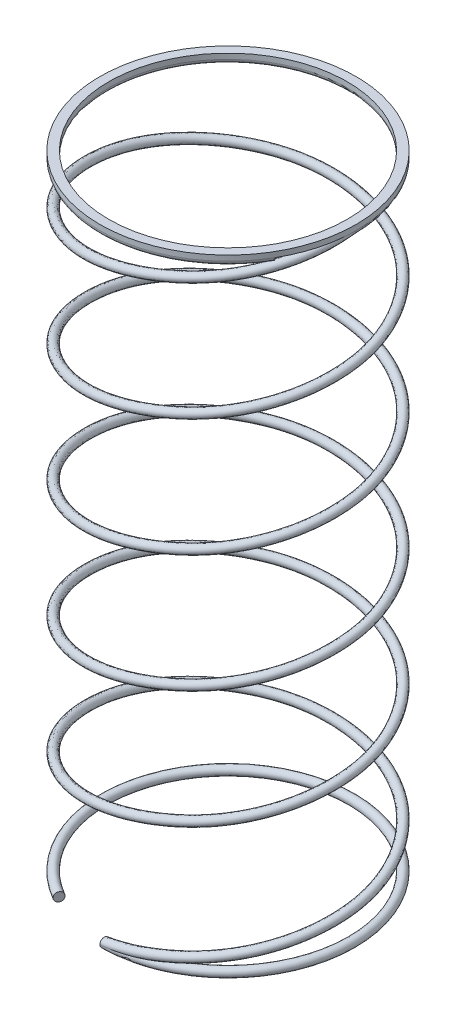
ISO-10303-21;
HEADER;
FILE_DESCRIPTION(('STEP AP214'),'2;1');
FILE_NAME('part.step','',(''),(''),'','','');
FILE_SCHEMA(('AUTOMOTIVE_DESIGN { 1 0 10303 214 1 1 1 1 }'));
ENDSEC;
DATA;
#1=APPLICATION_CONTEXT('core data for automotive mechanical design processes');
#2=APPLICATION_PROTOCOL_DEFINITION('international standard','automotive_design',2000,#1);
#3=PRODUCT_CONTEXT('',#1,'mechanical');
#4=PRODUCT('Part','Part','',(#3));
#5=PRODUCT_RELATED_PRODUCT_CATEGORY('part','',(#4));
#6=PRODUCT_DEFINITION_FORMATION('','',#4);
#7=PRODUCT_DEFINITION_CONTEXT('part definition',#1,'design');
#8=PRODUCT_DEFINITION('design','',#6,#7);
#9=PRODUCT_DEFINITION_SHAPE('','',#8);
#10=(LENGTH_UNIT() NAMED_UNIT(*) SI_UNIT(.MILLI.,.METRE.));
#11=(NAMED_UNIT(*) PLANE_ANGLE_UNIT() SI_UNIT($,.RADIAN.));
#12=(NAMED_UNIT(*) SI_UNIT($,.STERADIAN.) SOLID_ANGLE_UNIT());
#13=UNCERTAINTY_MEASURE_WITH_UNIT(LENGTH_MEASURE(1.E-05),#10,'distance_accuracy_value','');
#14=(GEOMETRIC_REPRESENTATION_CONTEXT(3) GLOBAL_UNCERTAINTY_ASSIGNED_CONTEXT((#13)) GLOBAL_UNIT_ASSIGNED_CONTEXT((#10,
#11,#12)) REPRESENTATION_CONTEXT('',''));
#15=CARTESIAN_POINT('',(0.,0.,0.));
#16=DIRECTION('',(0.,0.,1.));
#17=DIRECTION('',(1.,0.,0.));
#18=AXIS2_PLACEMENT_3D('',#15,#16,#17);
#19=CARTESIAN_POINT('',(7.2,0.,0.));
#20=CARTESIAN_POINT('',(7.2,-0.551587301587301,4.1569219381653));
#21=CARTESIAN_POINT('',(3.6,-1.1031746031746,6.23538290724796));
#22=CARTESIAN_POINT('',(0.,-1.6547619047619,8.31384387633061));
#23=CARTESIAN_POINT('',(-3.6,-2.2063492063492,6.23538290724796));
#24=CARTESIAN_POINT('',(-7.2,-2.7579365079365,4.15692193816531));
#25=CARTESIAN_POINT('',(-7.2,-3.3095238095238,0.));
#26=CARTESIAN_POINT('',(-7.2,-3.8611111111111,-4.1569219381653));
#27=CARTESIAN_POINT('',(-3.6,-4.41269841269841,-6.23538290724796));
#28=CARTESIAN_POINT('',(0.,-4.9642857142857,-8.31384387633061));
#29=CARTESIAN_POINT('',(3.6,-5.51587301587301,-6.23538290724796));
#30=CARTESIAN_POINT('',(7.2,-6.0674603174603,-4.15692193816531));
#31=CARTESIAN_POINT('',(7.2,-6.61904761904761,0.));
#32=CARTESIAN_POINT('',(7.2,-7.17063492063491,4.1569219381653));
#33=CARTESIAN_POINT('',(3.6,-7.72222222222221,6.23538290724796));
#34=CARTESIAN_POINT('',(0.,-8.27380952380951,8.31384387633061));
#35=CARTESIAN_POINT('',(-3.6,-8.82539682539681,6.23538290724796));
#36=CARTESIAN_POINT('',(-7.2,-9.37698412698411,4.15692193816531));
#37=CARTESIAN_POINT('',(-7.2,-9.92857142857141,0.));
#38=CARTESIAN_POINT('',(-7.2,-10.4801587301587,-4.1569219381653));
#39=CARTESIAN_POINT('',(-3.6,-11.031746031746,-6.23538290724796));
#40=CARTESIAN_POINT('',(0.,-11.5833333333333,-8.31384387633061));
#41=CARTESIAN_POINT('',(3.6,-12.1349206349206,-6.23538290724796));
#42=CARTESIAN_POINT('',(7.2,-12.6865079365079,-4.15692193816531));
#43=CARTESIAN_POINT('',(7.2,-13.2380952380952,0.));
#44=CARTESIAN_POINT('',(7.2,-13.7896825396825,4.1569219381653));
#45=CARTESIAN_POINT('',(3.6,-14.3412698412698,6.23538290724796));
#46=CARTESIAN_POINT('',(0.,-14.8928571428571,8.31384387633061));
#47=CARTESIAN_POINT('',(-3.6,-15.4444444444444,6.23538290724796));
#48=CARTESIAN_POINT('',(-7.2,-15.9960317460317,4.15692193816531));
#49=CARTESIAN_POINT('',(-7.2,-16.547619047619,0.));
#50=CARTESIAN_POINT('',(-7.2,-17.0992063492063,-4.1569219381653));
#51=CARTESIAN_POINT('',(-3.6,-17.6507936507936,-6.23538290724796));
#52=CARTESIAN_POINT('',(0.,-18.2023809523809,-8.31384387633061));
#53=CARTESIAN_POINT('',(3.6,-18.7539682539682,-6.23538290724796));
#54=CARTESIAN_POINT('',(7.2,-19.3055555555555,-4.15692193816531));
#55=CARTESIAN_POINT('',(7.2,-19.8571428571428,0.));
#56=CARTESIAN_POINT('',(7.2,-20.4087301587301,4.1569219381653));
#57=CARTESIAN_POINT('',(3.6,-20.9603174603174,6.23538290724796));
#58=CARTESIAN_POINT('',(0.,-21.5119047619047,8.31384387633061));
#59=CARTESIAN_POINT('',(-3.6,-22.063492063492,6.23538290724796));
#60=CARTESIAN_POINT('',(-7.2,-22.6150793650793,4.15692193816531));
#61=CARTESIAN_POINT('',(-7.2,-23.1666666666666,0.));
#62=CARTESIAN_POINT('',(-7.2,-23.7182539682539,-4.1569219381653));
#63=CARTESIAN_POINT('',(-3.6,-24.2698412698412,-6.23538290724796));
#64=CARTESIAN_POINT('',(0.,-24.8214285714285,-8.31384387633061));
#65=CARTESIAN_POINT('',(3.6,-25.3730158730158,-6.23538290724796));
#66=CARTESIAN_POINT('',(7.2,-25.9246031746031,-4.15692193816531));
#67=CARTESIAN_POINT('',(7.2,-26.4761904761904,0.));
#68=CARTESIAN_POINT('',(7.2,-27.0277777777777,4.1569219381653));
#69=CARTESIAN_POINT('',(3.6,-27.579365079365,6.23538290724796));
#70=CARTESIAN_POINT('',(0.,-28.1309523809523,8.31384387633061));
#71=CARTESIAN_POINT('',(-3.59999999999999,-28.6825396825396,6.23538290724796));
#72=CARTESIAN_POINT('',(-7.19999999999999,-29.2341269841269,4.15692193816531));
#73=CARTESIAN_POINT('',(-7.2,-29.7857142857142,0.));
#74=CARTESIAN_POINT('',(-7.2,-30.3373015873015,-4.1569219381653));
#75=CARTESIAN_POINT('',(-3.6,-30.8888888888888,-6.23538290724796));
#76=CARTESIAN_POINT('',(0.,-31.4404761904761,-8.31384387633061));
#77=CARTESIAN_POINT('',(3.6,-31.9920634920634,-6.23538290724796));
#78=CARTESIAN_POINT('',(7.2,-32.5436507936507,-4.15692193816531));
#79=CARTESIAN_POINT('',(7.2,-33.095238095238,0.));
#80=CARTESIAN_POINT('',(7.2,-33.6468253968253,4.1569219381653));
#81=CARTESIAN_POINT('',(3.6,-34.1984126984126,6.23538290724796));
#82=CARTESIAN_POINT('',(0.,-34.7499999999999,8.31384387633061));
#83=CARTESIAN_POINT('',(-3.59999999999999,-35.3015873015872,6.23538290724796));
#84=CARTESIAN_POINT('',(-7.19999999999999,-35.8531746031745,4.15692193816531));
#85=CARTESIAN_POINT('',(-7.2,-36.4047619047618,0.));
#86=CARTESIAN_POINT('',(-7.2,-36.9563492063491,-4.1569219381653));
#87=CARTESIAN_POINT('',(-3.6,-37.5079365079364,-6.23538290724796));
#88=CARTESIAN_POINT('',(0.,-38.0595238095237,-8.31384387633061));
#89=CARTESIAN_POINT('',(3.6,-38.611111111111,-6.23538290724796));
#90=CARTESIAN_POINT('',(7.2,-39.1626984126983,-4.15692193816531));
#91=CARTESIAN_POINT('',(7.2,-39.7142857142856,0.));
#92=CARTESIAN_POINT('',(7.2,0.499999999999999,0.));
#93=CARTESIAN_POINT('',(7.2,-0.0515873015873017,4.1569219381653));
#94=CARTESIAN_POINT('',(3.6,-0.603174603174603,6.23538290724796));
#95=CARTESIAN_POINT('',(0.,-1.1547619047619,8.31384387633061));
#96=CARTESIAN_POINT('',(-3.6,-1.7063492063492,6.23538290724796));
#97=CARTESIAN_POINT('',(-7.2,-2.25793650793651,4.15692193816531));
#98=CARTESIAN_POINT('',(-7.2,-2.80952380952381,0.));
#99=CARTESIAN_POINT('',(-7.2,-3.36111111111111,-4.1569219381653));
#100=CARTESIAN_POINT('',(-3.6,-3.91269841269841,-6.23538290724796));
#101=CARTESIAN_POINT('',(0.,-4.46428571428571,-8.31384387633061));
#102=CARTESIAN_POINT('',(3.6,-5.01587301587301,-6.23538290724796));
#103=CARTESIAN_POINT('',(7.2,-5.56746031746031,-4.15692193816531));
#104=CARTESIAN_POINT('',(7.2,-6.11904761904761,0.));
#105=CARTESIAN_POINT('',(7.2,-6.67063492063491,4.1569219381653));
#106=CARTESIAN_POINT('',(3.6,-7.22222222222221,6.23538290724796));
#107=CARTESIAN_POINT('',(0.,-7.77380952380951,8.31384387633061));
#108=CARTESIAN_POINT('',(-3.6,-8.32539682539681,6.23538290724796));
#109=CARTESIAN_POINT('',(-7.2,-8.87698412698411,4.15692193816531));
#110=CARTESIAN_POINT('',(-7.2,-9.42857142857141,0.));
#111=CARTESIAN_POINT('',(-7.2,-9.98015873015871,-4.1569219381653));
#112=CARTESIAN_POINT('',(-3.6,-10.531746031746,-6.23538290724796));
#113=CARTESIAN_POINT('',(0.,-11.0833333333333,-8.31384387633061));
#114=CARTESIAN_POINT('',(3.6,-11.6349206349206,-6.23538290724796));
#115=CARTESIAN_POINT('',(7.2,-12.1865079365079,-4.15692193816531));
#116=CARTESIAN_POINT('',(7.2,-12.7380952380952,0.));
#117=CARTESIAN_POINT('',(7.2,-13.2896825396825,4.1569219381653));
#118=CARTESIAN_POINT('',(3.6,-13.8412698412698,6.23538290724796));
#119=CARTESIAN_POINT('',(0.,-14.3928571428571,8.31384387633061));
#120=CARTESIAN_POINT('',(-3.6,-14.9444444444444,6.23538290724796));
#121=CARTESIAN_POINT('',(-7.2,-15.4960317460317,4.15692193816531));
#122=CARTESIAN_POINT('',(-7.2,-16.047619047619,0.));
#123=CARTESIAN_POINT('',(-7.2,-16.5992063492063,-4.1569219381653));
#124=CARTESIAN_POINT('',(-3.6,-17.1507936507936,-6.23538290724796));
#125=CARTESIAN_POINT('',(0.,-17.7023809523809,-8.31384387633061));
#126=CARTESIAN_POINT('',(3.6,-18.2539682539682,-6.23538290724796));
#127=CARTESIAN_POINT('',(7.2,-18.8055555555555,-4.15692193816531));
#128=CARTESIAN_POINT('',(7.2,-19.3571428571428,0.));
#129=CARTESIAN_POINT('',(7.2,-19.9087301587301,4.1569219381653));
#130=CARTESIAN_POINT('',(3.6,-20.4603174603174,6.23538290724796));
#131=CARTESIAN_POINT('',(0.,-21.0119047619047,8.31384387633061));
#132=CARTESIAN_POINT('',(-3.6,-21.563492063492,6.23538290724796));
#133=CARTESIAN_POINT('',(-7.2,-22.1150793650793,4.15692193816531));
#134=CARTESIAN_POINT('',(-7.2,-22.6666666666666,0.));
#135=CARTESIAN_POINT('',(-7.2,-23.2182539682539,-4.1569219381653));
#136=CARTESIAN_POINT('',(-3.6,-23.7698412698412,-6.23538290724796));
#137=CARTESIAN_POINT('',(0.,-24.3214285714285,-8.31384387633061));
#138=CARTESIAN_POINT('',(3.6,-24.8730158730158,-6.23538290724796));
#139=CARTESIAN_POINT('',(7.2,-25.4246031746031,-4.15692193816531));
#140=CARTESIAN_POINT('',(7.2,-25.9761904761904,0.));
#141=CARTESIAN_POINT('',(7.2,-26.5277777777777,4.1569219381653));
#142=CARTESIAN_POINT('',(3.6,-27.079365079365,6.23538290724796));
#143=CARTESIAN_POINT('',(0.,-27.6309523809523,8.31384387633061));
#144=CARTESIAN_POINT('',(-3.59999999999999,-28.1825396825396,6.23538290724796));
#145=CARTESIAN_POINT('',(-7.2,-28.7341269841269,4.15692193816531));
#146=CARTESIAN_POINT('',(-7.2,-29.2857142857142,0.));
#147=CARTESIAN_POINT('',(-7.2,-29.8373015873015,-4.1569219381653));
#148=CARTESIAN_POINT('',(-3.6,-30.3888888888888,-6.23538290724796));
#149=CARTESIAN_POINT('',(0.,-30.9404761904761,-8.31384387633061));
#150=CARTESIAN_POINT('',(3.6,-31.4920634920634,-6.23538290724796));
#151=CARTESIAN_POINT('',(7.2,-32.0436507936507,-4.15692193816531));
#152=CARTESIAN_POINT('',(7.2,-32.595238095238,0.));
#153=CARTESIAN_POINT('',(7.2,-33.1468253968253,4.1569219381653));
#154=CARTESIAN_POINT('',(3.6,-33.6984126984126,6.23538290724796));
#155=CARTESIAN_POINT('',(0.,-34.2499999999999,8.31384387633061));
#156=CARTESIAN_POINT('',(-3.59999999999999,-34.8015873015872,6.23538290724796));
#157=CARTESIAN_POINT('',(-7.19999999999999,-35.3531746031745,4.15692193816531));
#158=CARTESIAN_POINT('',(-7.2,-35.9047619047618,0.));
#159=CARTESIAN_POINT('',(-7.2,-36.4563492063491,-4.1569219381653));
#160=CARTESIAN_POINT('',(-3.6,-37.0079365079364,-6.23538290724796));
#161=CARTESIAN_POINT('',(0.,-37.5595238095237,-8.31384387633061));
#162=CARTESIAN_POINT('',(3.6,-38.111111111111,-6.23538290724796));
#163=CARTESIAN_POINT('',(7.2,-38.6626984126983,-4.15692193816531));
#164=CARTESIAN_POINT('',(7.2,-39.2142857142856,0.));
#165=CARTESIAN_POINT('',(6.7,0.499999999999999,0.));
#166=CARTESIAN_POINT('',(6.7,-0.0515873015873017,3.86824680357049));
#167=CARTESIAN_POINT('',(3.35,-0.603174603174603,5.80237020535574));
#168=CARTESIAN_POINT('',(0.,-1.1547619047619,7.73649360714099));
#169=CARTESIAN_POINT('',(-3.35,-1.7063492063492,5.80237020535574));
#170=CARTESIAN_POINT('',(-6.7,-2.25793650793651,3.8682468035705));
#171=CARTESIAN_POINT('',(-6.7,-2.80952380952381,0.));
#172=CARTESIAN_POINT('',(-6.7,-3.36111111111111,-3.86824680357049));
#173=CARTESIAN_POINT('',(-3.35,-3.91269841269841,-5.80237020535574));
#174=CARTESIAN_POINT('',(0.,-4.46428571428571,-7.73649360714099));
#175=CARTESIAN_POINT('',(3.35,-5.01587301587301,-5.80237020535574));
#176=CARTESIAN_POINT('',(6.7,-5.56746031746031,-3.8682468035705));
#177=CARTESIAN_POINT('',(6.7,-6.11904761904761,0.));
#178=CARTESIAN_POINT('',(6.7,-6.67063492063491,3.86824680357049));
#179=CARTESIAN_POINT('',(3.35,-7.22222222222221,5.80237020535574));
#180=CARTESIAN_POINT('',(0.,-7.77380952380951,7.73649360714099));
#181=CARTESIAN_POINT('',(-3.35,-8.32539682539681,5.80237020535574));
#182=CARTESIAN_POINT('',(-6.7,-8.87698412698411,3.8682468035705));
#183=CARTESIAN_POINT('',(-6.7,-9.42857142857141,0.));
#184=CARTESIAN_POINT('',(-6.7,-9.98015873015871,-3.86824680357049));
#185=CARTESIAN_POINT('',(-3.35,-10.531746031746,-5.80237020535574));
#186=CARTESIAN_POINT('',(0.,-11.0833333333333,-7.73649360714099));
#187=CARTESIAN_POINT('',(3.35,-11.6349206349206,-5.80237020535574));
#188=CARTESIAN_POINT('',(6.7,-12.1865079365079,-3.8682468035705));
#189=CARTESIAN_POINT('',(6.7,-12.7380952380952,0.));
#190=CARTESIAN_POINT('',(6.7,-13.2896825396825,3.86824680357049));
#191=CARTESIAN_POINT('',(3.35,-13.8412698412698,5.80237020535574));
#192=CARTESIAN_POINT('',(0.,-14.3928571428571,7.73649360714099));
#193=CARTESIAN_POINT('',(-3.35,-14.9444444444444,5.80237020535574));
#194=CARTESIAN_POINT('',(-6.7,-15.4960317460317,3.8682468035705));
#195=CARTESIAN_POINT('',(-6.7,-16.047619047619,0.));
#196=CARTESIAN_POINT('',(-6.7,-16.5992063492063,-3.86824680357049));
#197=CARTESIAN_POINT('',(-3.35,-17.1507936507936,-5.80237020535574));
#198=CARTESIAN_POINT('',(0.,-17.7023809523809,-7.73649360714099));
#199=CARTESIAN_POINT('',(3.35,-18.2539682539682,-5.80237020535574));
#200=CARTESIAN_POINT('',(6.7,-18.8055555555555,-3.8682468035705));
#201=CARTESIAN_POINT('',(6.7,-19.3571428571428,0.));
#202=CARTESIAN_POINT('',(6.7,-19.9087301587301,3.86824680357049));
#203=CARTESIAN_POINT('',(3.35,-20.4603174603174,5.80237020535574));
#204=CARTESIAN_POINT('',(0.,-21.0119047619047,7.73649360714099));
#205=CARTESIAN_POINT('',(-3.35,-21.563492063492,5.80237020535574));
#206=CARTESIAN_POINT('',(-6.7,-22.1150793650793,3.8682468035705));
#207=CARTESIAN_POINT('',(-6.7,-22.6666666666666,0.));
#208=CARTESIAN_POINT('',(-6.7,-23.2182539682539,-3.86824680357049));
#209=CARTESIAN_POINT('',(-3.35,-23.7698412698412,-5.80237020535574));
#210=CARTESIAN_POINT('',(0.,-24.3214285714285,-7.73649360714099));
#211=CARTESIAN_POINT('',(3.35,-24.8730158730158,-5.80237020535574));
#212=CARTESIAN_POINT('',(6.7,-25.4246031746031,-3.8682468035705));
#213=CARTESIAN_POINT('',(6.7,-25.9761904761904,0.));
#214=CARTESIAN_POINT('',(6.7,-26.5277777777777,3.86824680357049));
#215=CARTESIAN_POINT('',(3.35,-27.079365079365,5.80237020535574));
#216=CARTESIAN_POINT('',(0.,-27.6309523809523,7.73649360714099));
#217=CARTESIAN_POINT('',(-3.35,-28.1825396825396,5.80237020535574));
#218=CARTESIAN_POINT('',(-6.7,-28.7341269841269,3.8682468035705));
#219=CARTESIAN_POINT('',(-6.7,-29.2857142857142,0.));
#220=CARTESIAN_POINT('',(-6.7,-29.8373015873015,-3.86824680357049));
#221=CARTESIAN_POINT('',(-3.35,-30.3888888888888,-5.80237020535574));
#222=CARTESIAN_POINT('',(0.,-30.9404761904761,-7.73649360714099));
#223=CARTESIAN_POINT('',(3.35,-31.4920634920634,-5.80237020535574));
#224=CARTESIAN_POINT('',(6.7,-32.0436507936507,-3.8682468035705));
#225=CARTESIAN_POINT('',(6.70000000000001,-32.595238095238,0.));
#226=CARTESIAN_POINT('',(6.70000000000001,-33.1468253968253,3.86824680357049));
#227=CARTESIAN_POINT('',(3.35000000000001,-33.6984126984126,5.80237020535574));
#228=CARTESIAN_POINT('',(0.,-34.2499999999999,7.73649360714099));
#229=CARTESIAN_POINT('',(-3.34999999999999,-34.8015873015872,5.80237020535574));
#230=CARTESIAN_POINT('',(-6.7,-35.3531746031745,3.8682468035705));
#231=CARTESIAN_POINT('',(-6.7,-35.9047619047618,0.));
#232=CARTESIAN_POINT('',(-6.7,-36.4563492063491,-3.86824680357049));
#233=CARTESIAN_POINT('',(-3.35,-37.0079365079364,-5.80237020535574));
#234=CARTESIAN_POINT('',(0.,-37.5595238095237,-7.73649360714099));
#235=CARTESIAN_POINT('',(3.35,-38.111111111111,-5.80237020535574));
#236=CARTESIAN_POINT('',(6.7,-38.6626984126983,-3.8682468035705));
#237=CARTESIAN_POINT('',(6.70000000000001,-39.2142857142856,0.));
#238=CARTESIAN_POINT('',(6.7,0.,0.));
#239=CARTESIAN_POINT('',(6.7,-0.551587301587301,3.86824680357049));
#240=CARTESIAN_POINT('',(3.35,-1.1031746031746,5.80237020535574));
#241=CARTESIAN_POINT('',(0.,-1.6547619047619,7.73649360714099));
#242=CARTESIAN_POINT('',(-3.35,-2.2063492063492,5.80237020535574));
#243=CARTESIAN_POINT('',(-6.7,-2.7579365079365,3.8682468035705));
#244=CARTESIAN_POINT('',(-6.7,-3.3095238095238,0.));
#245=CARTESIAN_POINT('',(-6.7,-3.8611111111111,-3.86824680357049));
#246=CARTESIAN_POINT('',(-3.35,-4.41269841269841,-5.80237020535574));
#247=CARTESIAN_POINT('',(0.,-4.9642857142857,-7.73649360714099));
#248=CARTESIAN_POINT('',(3.35,-5.515873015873,-5.80237020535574));
#249=CARTESIAN_POINT('',(6.7,-6.0674603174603,-3.8682468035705));
#250=CARTESIAN_POINT('',(6.7,-6.61904761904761,0.));
#251=CARTESIAN_POINT('',(6.7,-7.17063492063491,3.86824680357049));
#252=CARTESIAN_POINT('',(3.35,-7.72222222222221,5.80237020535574));
#253=CARTESIAN_POINT('',(0.,-8.27380952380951,7.73649360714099));
#254=CARTESIAN_POINT('',(-3.35,-8.82539682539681,5.80237020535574));
#255=CARTESIAN_POINT('',(-6.7,-9.37698412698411,3.8682468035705));
#256=CARTESIAN_POINT('',(-6.7,-9.92857142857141,0.));
#257=CARTESIAN_POINT('',(-6.7,-10.4801587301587,-3.86824680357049));
#258=CARTESIAN_POINT('',(-3.35,-11.031746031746,-5.80237020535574));
#259=CARTESIAN_POINT('',(0.,-11.5833333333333,-7.73649360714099));
#260=CARTESIAN_POINT('',(3.35,-12.1349206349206,-5.80237020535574));
#261=CARTESIAN_POINT('',(6.7,-12.6865079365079,-3.8682468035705));
#262=CARTESIAN_POINT('',(6.7,-13.2380952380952,0.));
#263=CARTESIAN_POINT('',(6.7,-13.7896825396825,3.86824680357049));
#264=CARTESIAN_POINT('',(3.35,-14.3412698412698,5.80237020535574));
#265=CARTESIAN_POINT('',(0.,-14.8928571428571,7.73649360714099));
#266=CARTESIAN_POINT('',(-3.35,-15.4444444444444,5.80237020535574));
#267=CARTESIAN_POINT('',(-6.7,-15.9960317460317,3.8682468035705));
#268=CARTESIAN_POINT('',(-6.7,-16.547619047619,0.));
#269=CARTESIAN_POINT('',(-6.7,-17.0992063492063,-3.86824680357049));
#270=CARTESIAN_POINT('',(-3.35,-17.6507936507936,-5.80237020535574));
#271=CARTESIAN_POINT('',(0.,-18.2023809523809,-7.73649360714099));
#272=CARTESIAN_POINT('',(3.35,-18.7539682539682,-5.80237020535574));
#273=CARTESIAN_POINT('',(6.7,-19.3055555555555,-3.8682468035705));
#274=CARTESIAN_POINT('',(6.7,-19.8571428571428,0.));
#275=CARTESIAN_POINT('',(6.7,-20.4087301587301,3.86824680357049));
#276=CARTESIAN_POINT('',(3.35,-20.9603174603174,5.80237020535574));
#277=CARTESIAN_POINT('',(0.,-21.5119047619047,7.73649360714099));
#278=CARTESIAN_POINT('',(-3.35,-22.063492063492,5.80237020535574));
#279=CARTESIAN_POINT('',(-6.7,-22.6150793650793,3.8682468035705));
#280=CARTESIAN_POINT('',(-6.7,-23.1666666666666,0.));
#281=CARTESIAN_POINT('',(-6.7,-23.7182539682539,-3.86824680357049));
#282=CARTESIAN_POINT('',(-3.35,-24.2698412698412,-5.80237020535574));
#283=CARTESIAN_POINT('',(0.,-24.8214285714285,-7.73649360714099));
#284=CARTESIAN_POINT('',(3.35,-25.3730158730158,-5.80237020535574));
#285=CARTESIAN_POINT('',(6.7,-25.9246031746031,-3.8682468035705));
#286=CARTESIAN_POINT('',(6.7,-26.4761904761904,0.));
#287=CARTESIAN_POINT('',(6.7,-27.0277777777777,3.86824680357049));
#288=CARTESIAN_POINT('',(3.35,-27.579365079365,5.80237020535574));
#289=CARTESIAN_POINT('',(0.,-28.1309523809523,7.73649360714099));
#290=CARTESIAN_POINT('',(-3.35,-28.6825396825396,5.80237020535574));
#291=CARTESIAN_POINT('',(-6.7,-29.2341269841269,3.8682468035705));
#292=CARTESIAN_POINT('',(-6.7,-29.7857142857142,0.));
#293=CARTESIAN_POINT('',(-6.7,-30.3373015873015,-3.86824680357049));
#294=CARTESIAN_POINT('',(-3.35,-30.8888888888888,-5.80237020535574));
#295=CARTESIAN_POINT('',(0.,-31.4404761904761,-7.73649360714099));
#296=CARTESIAN_POINT('',(3.35,-31.9920634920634,-5.80237020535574));
#297=CARTESIAN_POINT('',(6.7,-32.5436507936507,-3.8682468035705));
#298=CARTESIAN_POINT('',(6.70000000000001,-33.095238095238,0.));
#299=CARTESIAN_POINT('',(6.70000000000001,-33.6468253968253,3.86824680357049));
#300=CARTESIAN_POINT('',(3.35000000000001,-34.1984126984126,5.80237020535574));
#301=CARTESIAN_POINT('',(0.,-34.7499999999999,7.73649360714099));
#302=CARTESIAN_POINT('',(-3.34999999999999,-35.3015873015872,5.80237020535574));
#303=CARTESIAN_POINT('',(-6.69999999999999,-35.8531746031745,3.8682468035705));
#304=CARTESIAN_POINT('',(-6.7,-36.4047619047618,0.));
#305=CARTESIAN_POINT('',(-6.7,-36.9563492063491,-3.86824680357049));
#306=CARTESIAN_POINT('',(-3.35,-37.5079365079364,-5.80237020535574));
#307=CARTESIAN_POINT('',(0.,-38.0595238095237,-7.73649360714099));
#308=CARTESIAN_POINT('',(3.35,-38.611111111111,-5.80237020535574));
#309=CARTESIAN_POINT('',(6.7,-39.1626984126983,-3.8682468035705));
#310=CARTESIAN_POINT('',(6.70000000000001,-39.7142857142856,0.));
#311=CARTESIAN_POINT('',(6.7,-0.499999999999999,0.));
#312=CARTESIAN_POINT('',(6.7,-1.0515873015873,3.86824680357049));
#313=CARTESIAN_POINT('',(3.35,-1.6031746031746,5.80237020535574));
#314=CARTESIAN_POINT('',(0.,-2.1547619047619,7.73649360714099));
#315=CARTESIAN_POINT('',(-3.35,-2.7063492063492,5.80237020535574));
#316=CARTESIAN_POINT('',(-6.7,-3.2579365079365,3.8682468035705));
#317=CARTESIAN_POINT('',(-6.7,-3.8095238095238,0.));
#318=CARTESIAN_POINT('',(-6.7,-4.3611111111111,-3.86824680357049));
#319=CARTESIAN_POINT('',(-3.35,-4.9126984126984,-5.80237020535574));
#320=CARTESIAN_POINT('',(0.,-5.4642857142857,-7.73649360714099));
#321=CARTESIAN_POINT('',(3.35,-6.01587301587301,-5.80237020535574));
#322=CARTESIAN_POINT('',(6.7,-6.5674603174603,-3.8682468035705));
#323=CARTESIAN_POINT('',(6.7,-7.1190476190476,0.));
#324=CARTESIAN_POINT('',(6.7,-7.67063492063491,3.86824680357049));
#325=CARTESIAN_POINT('',(3.35,-8.22222222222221,5.80237020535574));
#326=CARTESIAN_POINT('',(0.,-8.77380952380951,7.73649360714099));
#327=CARTESIAN_POINT('',(-3.35,-9.32539682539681,5.80237020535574));
#328=CARTESIAN_POINT('',(-6.7,-9.87698412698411,3.8682468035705));
#329=CARTESIAN_POINT('',(-6.7,-10.4285714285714,0.));
#330=CARTESIAN_POINT('',(-6.7,-10.9801587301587,-3.86824680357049));
#331=CARTESIAN_POINT('',(-3.35,-11.531746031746,-5.80237020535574));
#332=CARTESIAN_POINT('',(0.,-12.0833333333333,-7.73649360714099));
#333=CARTESIAN_POINT('',(3.35,-12.6349206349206,-5.80237020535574));
#334=CARTESIAN_POINT('',(6.7,-13.1865079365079,-3.8682468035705));
#335=CARTESIAN_POINT('',(6.7,-13.7380952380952,0.));
#336=CARTESIAN_POINT('',(6.7,-14.2896825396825,3.86824680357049));
#337=CARTESIAN_POINT('',(3.35,-14.8412698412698,5.80237020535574));
#338=CARTESIAN_POINT('',(0.,-15.3928571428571,7.73649360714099));
#339=CARTESIAN_POINT('',(-3.35,-15.9444444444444,5.80237020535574));
#340=CARTESIAN_POINT('',(-6.7,-16.4960317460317,3.8682468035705));
#341=CARTESIAN_POINT('',(-6.7,-17.047619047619,0.));
#342=CARTESIAN_POINT('',(-6.7,-17.5992063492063,-3.86824680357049));
#343=CARTESIAN_POINT('',(-3.35,-18.1507936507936,-5.80237020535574));
#344=CARTESIAN_POINT('',(0.,-18.7023809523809,-7.73649360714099));
#345=CARTESIAN_POINT('',(3.35,-19.2539682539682,-5.80237020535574));
#346=CARTESIAN_POINT('',(6.7,-19.8055555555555,-3.8682468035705));
#347=CARTESIAN_POINT('',(6.7,-20.3571428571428,0.));
#348=CARTESIAN_POINT('',(6.7,-20.9087301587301,3.86824680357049));
#349=CARTESIAN_POINT('',(3.35,-21.4603174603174,5.80237020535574));
#350=CARTESIAN_POINT('',(0.,-22.0119047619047,7.73649360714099));
#351=CARTESIAN_POINT('',(-3.35,-22.563492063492,5.80237020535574));
#352=CARTESIAN_POINT('',(-6.7,-23.1150793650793,3.8682468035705));
#353=CARTESIAN_POINT('',(-6.7,-23.6666666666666,0.));
#354=CARTESIAN_POINT('',(-6.7,-24.2182539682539,-3.86824680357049));
#355=CARTESIAN_POINT('',(-3.35,-24.7698412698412,-5.80237020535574));
#356=CARTESIAN_POINT('',(0.,-25.3214285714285,-7.73649360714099));
#357=CARTESIAN_POINT('',(3.35,-25.8730158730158,-5.80237020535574));
#358=CARTESIAN_POINT('',(6.7,-26.4246031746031,-3.8682468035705));
#359=CARTESIAN_POINT('',(6.7,-26.9761904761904,0.));
#360=CARTESIAN_POINT('',(6.7,-27.5277777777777,3.86824680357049));
#361=CARTESIAN_POINT('',(3.35,-28.079365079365,5.80237020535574));
#362=CARTESIAN_POINT('',(0.,-28.6309523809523,7.73649360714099));
#363=CARTESIAN_POINT('',(-3.35,-29.1825396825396,5.80237020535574));
#364=CARTESIAN_POINT('',(-6.7,-29.7341269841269,3.8682468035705));
#365=CARTESIAN_POINT('',(-6.7,-30.2857142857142,0.));
#366=CARTESIAN_POINT('',(-6.7,-30.8373015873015,-3.86824680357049));
#367=CARTESIAN_POINT('',(-3.35,-31.3888888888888,-5.80237020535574));
#368=CARTESIAN_POINT('',(0.,-31.9404761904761,-7.73649360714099));
#369=CARTESIAN_POINT('',(3.35,-32.4920634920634,-5.80237020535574));
#370=CARTESIAN_POINT('',(6.7,-33.0436507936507,-3.8682468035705));
#371=CARTESIAN_POINT('',(6.70000000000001,-33.595238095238,0.));
#372=CARTESIAN_POINT('',(6.70000000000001,-34.1468253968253,3.86824680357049));
#373=CARTESIAN_POINT('',(3.35000000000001,-34.6984126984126,5.80237020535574));
#374=CARTESIAN_POINT('',(0.,-35.2499999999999,7.73649360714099));
#375=CARTESIAN_POINT('',(-3.34999999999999,-35.8015873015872,5.80237020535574));
#376=CARTESIAN_POINT('',(-6.7,-36.3531746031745,3.8682468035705));
#377=CARTESIAN_POINT('',(-6.7,-36.9047619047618,0.));
#378=CARTESIAN_POINT('',(-6.7,-37.4563492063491,-3.86824680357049));
#379=CARTESIAN_POINT('',(-3.35,-38.0079365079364,-5.80237020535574));
#380=CARTESIAN_POINT('',(0.,-38.5595238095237,-7.73649360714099));
#381=CARTESIAN_POINT('',(3.35,-39.111111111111,-5.80237020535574));
#382=CARTESIAN_POINT('',(6.7,-39.6626984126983,-3.8682468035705));
#383=CARTESIAN_POINT('',(6.70000000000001,-40.2142857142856,0.));
#384=CARTESIAN_POINT('',(7.2,-0.499999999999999,0.));
#385=CARTESIAN_POINT('',(7.2,-1.0515873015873,4.1569219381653));
#386=CARTESIAN_POINT('',(3.6,-1.6031746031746,6.23538290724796));
#387=CARTESIAN_POINT('',(0.,-2.1547619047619,8.31384387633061));
#388=CARTESIAN_POINT('',(-3.6,-2.7063492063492,6.23538290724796));
#389=CARTESIAN_POINT('',(-7.2,-3.2579365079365,4.15692193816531));
#390=CARTESIAN_POINT('',(-7.2,-3.8095238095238,0.));
#391=CARTESIAN_POINT('',(-7.2,-4.3611111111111,-4.1569219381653));
#392=CARTESIAN_POINT('',(-3.6,-4.9126984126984,-6.23538290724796));
#393=CARTESIAN_POINT('',(0.,-5.4642857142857,-8.31384387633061));
#394=CARTESIAN_POINT('',(3.6,-6.01587301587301,-6.23538290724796));
#395=CARTESIAN_POINT('',(7.2,-6.5674603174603,-4.15692193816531));
#396=CARTESIAN_POINT('',(7.2,-7.1190476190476,0.));
#397=CARTESIAN_POINT('',(7.2,-7.67063492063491,4.1569219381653));
#398=CARTESIAN_POINT('',(3.6,-8.22222222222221,6.23538290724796));
#399=CARTESIAN_POINT('',(0.,-8.77380952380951,8.31384387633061));
#400=CARTESIAN_POINT('',(-3.6,-9.32539682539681,6.23538290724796));
#401=CARTESIAN_POINT('',(-7.2,-9.87698412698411,4.15692193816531));
#402=CARTESIAN_POINT('',(-7.2,-10.4285714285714,0.));
#403=CARTESIAN_POINT('',(-7.2,-10.9801587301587,-4.1569219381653));
#404=CARTESIAN_POINT('',(-3.6,-11.531746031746,-6.23538290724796));
#405=CARTESIAN_POINT('',(0.,-12.0833333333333,-8.31384387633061));
#406=CARTESIAN_POINT('',(3.6,-12.6349206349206,-6.23538290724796));
#407=CARTESIAN_POINT('',(7.2,-13.1865079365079,-4.15692193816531));
#408=CARTESIAN_POINT('',(7.2,-13.7380952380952,0.));
#409=CARTESIAN_POINT('',(7.2,-14.2896825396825,4.1569219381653));
#410=CARTESIAN_POINT('',(3.6,-14.8412698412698,6.23538290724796));
#411=CARTESIAN_POINT('',(0.,-15.3928571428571,8.31384387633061));
#412=CARTESIAN_POINT('',(-3.6,-15.9444444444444,6.23538290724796));
#413=CARTESIAN_POINT('',(-7.2,-16.4960317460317,4.15692193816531));
#414=CARTESIAN_POINT('',(-7.2,-17.047619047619,0.));
#415=CARTESIAN_POINT('',(-7.2,-17.5992063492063,-4.1569219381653));
#416=CARTESIAN_POINT('',(-3.6,-18.1507936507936,-6.23538290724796));
#417=CARTESIAN_POINT('',(0.,-18.7023809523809,-8.31384387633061));
#418=CARTESIAN_POINT('',(3.6,-19.2539682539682,-6.23538290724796));
#419=CARTESIAN_POINT('',(7.2,-19.8055555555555,-4.15692193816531));
#420=CARTESIAN_POINT('',(7.2,-20.3571428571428,0.));
#421=CARTESIAN_POINT('',(7.2,-20.9087301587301,4.1569219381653));
#422=CARTESIAN_POINT('',(3.6,-21.4603174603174,6.23538290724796));
#423=CARTESIAN_POINT('',(0.,-22.0119047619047,8.31384387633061));
#424=CARTESIAN_POINT('',(-3.6,-22.563492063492,6.23538290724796));
#425=CARTESIAN_POINT('',(-7.2,-23.1150793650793,4.15692193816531));
#426=CARTESIAN_POINT('',(-7.2,-23.6666666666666,0.));
#427=CARTESIAN_POINT('',(-7.2,-24.2182539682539,-4.1569219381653));
#428=CARTESIAN_POINT('',(-3.6,-24.7698412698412,-6.23538290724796));
#429=CARTESIAN_POINT('',(0.,-25.3214285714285,-8.31384387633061));
#430=CARTESIAN_POINT('',(3.6,-25.8730158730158,-6.23538290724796));
#431=CARTESIAN_POINT('',(7.2,-26.4246031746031,-4.15692193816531));
#432=CARTESIAN_POINT('',(7.2,-26.9761904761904,0.));
#433=CARTESIAN_POINT('',(7.2,-27.5277777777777,4.1569219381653));
#434=CARTESIAN_POINT('',(3.6,-28.079365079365,6.23538290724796));
#435=CARTESIAN_POINT('',(0.,-28.6309523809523,8.31384387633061));
#436=CARTESIAN_POINT('',(-3.59999999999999,-29.1825396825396,6.23538290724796));
#437=CARTESIAN_POINT('',(-7.2,-29.7341269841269,4.15692193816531));
#438=CARTESIAN_POINT('',(-7.2,-30.2857142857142,0.));
#439=CARTESIAN_POINT('',(-7.2,-30.8373015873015,-4.1569219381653));
#440=CARTESIAN_POINT('',(-3.6,-31.3888888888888,-6.23538290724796));
#441=CARTESIAN_POINT('',(0.,-31.9404761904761,-8.31384387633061));
#442=CARTESIAN_POINT('',(3.6,-32.4920634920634,-6.23538290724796));
#443=CARTESIAN_POINT('',(7.2,-33.0436507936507,-4.15692193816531));
#444=CARTESIAN_POINT('',(7.2,-33.595238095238,0.));
#445=CARTESIAN_POINT('',(7.2,-34.1468253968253,4.1569219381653));
#446=CARTESIAN_POINT('',(3.6,-34.6984126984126,6.23538290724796));
#447=CARTESIAN_POINT('',(0.,-35.2499999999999,8.31384387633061));
#448=CARTESIAN_POINT('',(-3.59999999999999,-35.8015873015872,6.23538290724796));
#449=CARTESIAN_POINT('',(-7.19999999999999,-36.3531746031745,4.15692193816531));
#450=CARTESIAN_POINT('',(-7.2,-36.9047619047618,0.));
#451=CARTESIAN_POINT('',(-7.2,-37.4563492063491,-4.1569219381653));
#452=CARTESIAN_POINT('',(-3.6,-38.0079365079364,-6.23538290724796));
#453=CARTESIAN_POINT('',(0.,-38.5595238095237,-8.31384387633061));
#454=CARTESIAN_POINT('',(3.6,-39.111111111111,-6.23538290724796));
#455=CARTESIAN_POINT('',(7.2,-39.6626984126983,-4.15692193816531));
#456=CARTESIAN_POINT('',(7.2,-40.2142857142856,0.));
#457=CARTESIAN_POINT('',(7.2,0.,0.));
#458=CARTESIAN_POINT('',(7.2,-0.551587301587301,4.1569219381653));
#459=CARTESIAN_POINT('',(3.6,-1.1031746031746,6.23538290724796));
#460=CARTESIAN_POINT('',(0.,-1.6547619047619,8.31384387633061));
#461=CARTESIAN_POINT('',(-3.6,-2.2063492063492,6.23538290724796));
#462=CARTESIAN_POINT('',(-7.2,-2.7579365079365,4.15692193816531));
#463=CARTESIAN_POINT('',(-7.2,-3.3095238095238,0.));
#464=CARTESIAN_POINT('',(-7.2,-3.8611111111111,-4.1569219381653));
#465=CARTESIAN_POINT('',(-3.6,-4.41269841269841,-6.23538290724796));
#466=CARTESIAN_POINT('',(0.,-4.9642857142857,-8.31384387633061));
#467=CARTESIAN_POINT('',(3.6,-5.51587301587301,-6.23538290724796));
#468=CARTESIAN_POINT('',(7.2,-6.0674603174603,-4.15692193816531));
#469=CARTESIAN_POINT('',(7.2,-6.61904761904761,0.));
#470=CARTESIAN_POINT('',(7.2,-7.17063492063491,4.1569219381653));
#471=CARTESIAN_POINT('',(3.6,-7.72222222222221,6.23538290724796));
#472=CARTESIAN_POINT('',(0.,-8.27380952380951,8.31384387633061));
#473=CARTESIAN_POINT('',(-3.6,-8.82539682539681,6.23538290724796));
#474=CARTESIAN_POINT('',(-7.2,-9.37698412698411,4.15692193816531));
#475=CARTESIAN_POINT('',(-7.2,-9.92857142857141,0.));
#476=CARTESIAN_POINT('',(-7.2,-10.4801587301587,-4.1569219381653));
#477=CARTESIAN_POINT('',(-3.6,-11.031746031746,-6.23538290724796));
#478=CARTESIAN_POINT('',(0.,-11.5833333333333,-8.31384387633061));
#479=CARTESIAN_POINT('',(3.6,-12.1349206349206,-6.23538290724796));
#480=CARTESIAN_POINT('',(7.2,-12.6865079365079,-4.15692193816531));
#481=CARTESIAN_POINT('',(7.2,-13.2380952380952,0.));
#482=CARTESIAN_POINT('',(7.2,-13.7896825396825,4.1569219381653));
#483=CARTESIAN_POINT('',(3.6,-14.3412698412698,6.23538290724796));
#484=CARTESIAN_POINT('',(0.,-14.8928571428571,8.31384387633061));
#485=CARTESIAN_POINT('',(-3.6,-15.4444444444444,6.23538290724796));
#486=CARTESIAN_POINT('',(-7.2,-15.9960317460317,4.15692193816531));
#487=CARTESIAN_POINT('',(-7.2,-16.547619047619,0.));
#488=CARTESIAN_POINT('',(-7.2,-17.0992063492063,-4.1569219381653));
#489=CARTESIAN_POINT('',(-3.6,-17.6507936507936,-6.23538290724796));
#490=CARTESIAN_POINT('',(0.,-18.2023809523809,-8.31384387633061));
#491=CARTESIAN_POINT('',(3.6,-18.7539682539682,-6.23538290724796));
#492=CARTESIAN_POINT('',(7.2,-19.3055555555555,-4.15692193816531));
#493=CARTESIAN_POINT('',(7.2,-19.8571428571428,0.));
#494=CARTESIAN_POINT('',(7.2,-20.4087301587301,4.1569219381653));
#495=CARTESIAN_POINT('',(3.6,-20.9603174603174,6.23538290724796));
#496=CARTESIAN_POINT('',(0.,-21.5119047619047,8.31384387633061));
#497=CARTESIAN_POINT('',(-3.6,-22.063492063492,6.23538290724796));
#498=CARTESIAN_POINT('',(-7.2,-22.6150793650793,4.15692193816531));
#499=CARTESIAN_POINT('',(-7.2,-23.1666666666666,0.));
#500=CARTESIAN_POINT('',(-7.2,-23.7182539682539,-4.1569219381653));
#501=CARTESIAN_POINT('',(-3.6,-24.2698412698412,-6.23538290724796));
#502=CARTESIAN_POINT('',(0.,-24.8214285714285,-8.31384387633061));
#503=CARTESIAN_POINT('',(3.6,-25.3730158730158,-6.23538290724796));
#504=CARTESIAN_POINT('',(7.2,-25.9246031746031,-4.15692193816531));
#505=CARTESIAN_POINT('',(7.2,-26.4761904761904,0.));
#506=CARTESIAN_POINT('',(7.2,-27.0277777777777,4.1569219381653));
#507=CARTESIAN_POINT('',(3.6,-27.579365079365,6.23538290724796));
#508=CARTESIAN_POINT('',(0.,-28.1309523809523,8.31384387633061));
#509=CARTESIAN_POINT('',(-3.59999999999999,-28.6825396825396,6.23538290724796));
#510=CARTESIAN_POINT('',(-7.19999999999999,-29.2341269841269,4.15692193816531));
#511=CARTESIAN_POINT('',(-7.2,-29.7857142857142,0.));
#512=CARTESIAN_POINT('',(-7.2,-30.3373015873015,-4.1569219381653));
#513=CARTESIAN_POINT('',(-3.6,-30.8888888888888,-6.23538290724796));
#514=CARTESIAN_POINT('',(0.,-31.4404761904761,-8.31384387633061));
#515=CARTESIAN_POINT('',(3.6,-31.9920634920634,-6.23538290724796));
#516=CARTESIAN_POINT('',(7.2,-32.5436507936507,-4.15692193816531));
#517=CARTESIAN_POINT('',(7.2,-33.095238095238,0.));
#518=CARTESIAN_POINT('',(7.2,-33.6468253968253,4.1569219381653));
#519=CARTESIAN_POINT('',(3.6,-34.1984126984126,6.23538290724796));
#520=CARTESIAN_POINT('',(0.,-34.7499999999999,8.31384387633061));
#521=CARTESIAN_POINT('',(-3.59999999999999,-35.3015873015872,6.23538290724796));
#522=CARTESIAN_POINT('',(-7.19999999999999,-35.8531746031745,4.15692193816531));
#523=CARTESIAN_POINT('',(-7.2,-36.4047619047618,0.));
#524=CARTESIAN_POINT('',(-7.2,-36.9563492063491,-4.1569219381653));
#525=CARTESIAN_POINT('',(-3.6,-37.5079365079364,-6.23538290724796));
#526=CARTESIAN_POINT('',(0.,-38.0595238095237,-8.31384387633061));
#527=CARTESIAN_POINT('',(3.6,-38.611111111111,-6.23538290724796));
#528=CARTESIAN_POINT('',(7.2,-39.1626984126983,-4.15692193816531));
#529=CARTESIAN_POINT('',(7.2,-39.7142857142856,0.));
#530=(BOUNDED_SURFACE() B_SPLINE_SURFACE(3,2,((#19,#20,#21,#22,#23,#24,#25,#26,#27,#28,#29,#30,
#31,#32,#33,#34,#35,#36,#37,#38,#39,#40,#41,#42,#43,#44,#45,#46,#47,#48,#49,#50,#51,#52,#53,#54,
#55,#56,#57,#58,#59,#60,#61,#62,#63,#64,#65,#66,#67,#68,#69,#70,#71,#72,#73,#74,#75,#76,#77,#78,
#79,#80,#81,#82,#83,#84,#85,#86,#87,#88,#89,#90,#91),(#92,#93,#94,#95,#96,#97,#98,#99,#100,#101,
#102,#103,#104,#105,#106,#107,#108,#109,#110,#111,#112,#113,#114,#115,#116,#117,#118,#119,#120,
#121,#122,#123,#124,#125,#126,#127,#128,#129,#130,#131,#132,#133,#134,#135,#136,#137,#138,#139,
#140,#141,#142,#143,#144,#145,#146,#147,#148,#149,#150,#151,#152,#153,#154,#155,#156,#157,#158,
#159,#160,#161,#162,#163,#164),(#165,#166,#167,#168,#169,#170,#171,#172,#173,#174,#175,#176,
#177,#178,#179,#180,#181,#182,#183,#184,#185,#186,#187,#188,#189,#190,#191,#192,#193,#194,#195,
#196,#197,#198,#199,#200,#201,#202,#203,#204,#205,#206,#207,#208,#209,#210,#211,#212,#213,#214,
#215,#216,#217,#218,#219,#220,#221,#222,#223,#224,#225,#226,#227,#228,#229,#230,#231,#232,#233,
#234,#235,#236,#237),(#238,#239,#240,#241,#242,#243,#244,#245,#246,#247,#248,#249,#250,#251,
#252,#253,#254,#255,#256,#257,#258,#259,#260,#261,#262,#263,#264,#265,#266,#267,#268,#269,#270,
#271,#272,#273,#274,#275,#276,#277,#278,#279,#280,#281,#282,#283,#284,#285,#286,#287,#288,#289,
#290,#291,#292,#293,#294,#295,#296,#297,#298,#299,#300,#301,#302,#303,#304,#305,#306,#307,#308,
#309,#310),(#311,#312,#313,#314,#315,#316,#317,#318,#319,#320,#321,#322,#323,#324,#325,#326,
#327,#328,#329,#330,#331,#332,#333,#334,#335,#336,#337,#338,#339,#340,#341,#342,#343,#344,#345,
#346,#347,#348,#349,#350,#351,#352,#353,#354,#355,#356,#357,#358,#359,#360,#361,#362,#363,#364,
#365,#366,#367,#368,#369,#370,#371,#372,#373,#374,#375,#376,#377,#378,#379,#380,#381,#382,#383),
(#384,#385,#386,#387,#388,#389,#390,#391,#392,#393,#394,#395,#396,#397,#398,#399,#400,#401,#402,
#403,#404,#405,#406,#407,#408,#409,#410,#411,#412,#413,#414,#415,#416,#417,#418,#419,#420,#421,
#422,#423,#424,#425,#426,#427,#428,#429,#430,#431,#432,#433,#434,#435,#436,#437,#438,#439,#440,
#441,#442,#443,#444,#445,#446,#447,#448,#449,#450,#451,#452,#453,#454,#455,#456),(#457,#458,
#459,#460,#461,#462,#463,#464,#465,#466,#467,#468,#469,#470,#471,#472,#473,#474,#475,#476,#477,
#478,#479,#480,#481,#482,#483,#484,#485,#486,#487,#488,#489,#490,#491,#492,#493,#494,#495,#496,
#497,#498,#499,#500,#501,#502,#503,#504,#505,#506,#507,#508,#509,#510,#511,#512,#513,#514,#515,
#516,#517,#518,#519,#520,#521,#522,#523,#524,#525,#526,#527,#528,#529)),.UNSPECIFIED.,.T.,.F.,
.F.) B_SPLINE_SURFACE_WITH_KNOTS((4,3,4),(3,2,2,2,2,2,2,2,2,2,2,2,2,2,2,2,2,2,2,2,2,2,2,2,2,2,2,
2,2,2,2,2,2,2,2,2,3),(0.,0.5,1.),(0.,0.0277777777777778,0.0555555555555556,0.0833333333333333,
0.111111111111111,0.138888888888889,0.166666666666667,0.194444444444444,0.222222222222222,0.25,
0.277777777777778,0.305555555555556,0.333333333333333,0.361111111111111,0.388888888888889,
0.416666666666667,0.444444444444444,0.472222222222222,0.5,0.527777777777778,0.555555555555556,
0.583333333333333,0.611111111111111,0.638888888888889,0.666666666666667,0.694444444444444,
0.722222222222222,0.75,0.777777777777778,0.805555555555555,0.833333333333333,0.861111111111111,
0.888888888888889,0.916666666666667,0.944444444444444,0.972222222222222,1.),
.UNSPECIFIED.) GEOMETRIC_REPRESENTATION_ITEM() RATIONAL_B_SPLINE_SURFACE(((1.,0.866025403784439,
1.,0.866025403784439,1.,0.866025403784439,1.,0.866025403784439,1.,0.866025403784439,1.,
0.866025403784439,1.,0.866025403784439,1.,0.866025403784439,1.,0.866025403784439,1.,
0.866025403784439,1.,0.866025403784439,1.,0.866025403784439,1.,0.866025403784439,1.,
0.866025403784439,1.,0.866025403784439,1.,0.866025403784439,1.,0.866025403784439,1.,
0.866025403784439,1.,0.866025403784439,1.,0.866025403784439,1.,0.866025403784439,1.,
0.866025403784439,1.,0.866025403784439,1.,0.866025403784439,1.,0.866025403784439,1.,
0.866025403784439,1.,0.866025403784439,1.,0.866025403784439,1.,0.866025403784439,1.,
0.866025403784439,1.,0.866025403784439,1.,0.866025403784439,1.,0.866025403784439,1.,
0.866025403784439,1.,0.866025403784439,1.,0.866025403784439,1.),(0.333333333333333,
0.288675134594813,0.333333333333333,0.288675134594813,0.333333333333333,0.288675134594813,
0.333333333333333,0.288675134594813,0.333333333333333,0.288675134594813,0.333333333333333,
0.288675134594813,0.333333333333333,0.288675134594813,0.333333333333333,0.288675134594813,
0.333333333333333,0.288675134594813,0.333333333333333,0.288675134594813,0.333333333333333,
0.288675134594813,0.333333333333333,0.288675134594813,0.333333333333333,0.288675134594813,
0.333333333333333,0.288675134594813,0.333333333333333,0.288675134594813,0.333333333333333,
0.288675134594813,0.333333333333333,0.288675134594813,0.333333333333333,0.288675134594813,
0.333333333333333,0.288675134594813,0.333333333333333,0.288675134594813,0.333333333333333,
0.288675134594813,0.333333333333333,0.288675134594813,0.333333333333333,0.288675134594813,
0.333333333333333,0.288675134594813,0.333333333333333,0.288675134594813,0.333333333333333,
0.288675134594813,0.333333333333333,0.288675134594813,0.333333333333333,0.288675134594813,
0.333333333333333,0.288675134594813,0.333333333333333,0.288675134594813,0.333333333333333,
0.288675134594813,0.333333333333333,0.288675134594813,0.333333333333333,0.288675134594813,
0.333333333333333,0.288675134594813,0.333333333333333,0.288675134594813,0.333333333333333,
0.288675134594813,0.333333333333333),(0.333333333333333,0.288675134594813,0.333333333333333,
0.288675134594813,0.333333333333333,0.288675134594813,0.333333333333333,0.288675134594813,
0.333333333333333,0.288675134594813,0.333333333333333,0.288675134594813,0.333333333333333,
0.288675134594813,0.333333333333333,0.288675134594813,0.333333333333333,0.288675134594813,
0.333333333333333,0.288675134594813,0.333333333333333,0.288675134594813,0.333333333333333,
0.288675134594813,0.333333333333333,0.288675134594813,0.333333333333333,0.288675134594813,
0.333333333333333,0.288675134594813,0.333333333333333,0.288675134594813,0.333333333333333,
0.288675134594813,0.333333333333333,0.288675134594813,0.333333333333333,0.288675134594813,
0.333333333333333,0.288675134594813,0.333333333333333,0.288675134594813,0.333333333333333,
0.288675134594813,0.333333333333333,0.288675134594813,0.333333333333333,0.288675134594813,
0.333333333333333,0.288675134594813,0.333333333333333,0.288675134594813,0.333333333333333,
0.288675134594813,0.333333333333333,0.288675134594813,0.333333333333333,0.288675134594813,
0.333333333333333,0.288675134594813,0.333333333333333,0.288675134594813,0.333333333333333,
0.288675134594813,0.333333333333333,0.288675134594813,0.333333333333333,0.288675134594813,
0.333333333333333,0.288675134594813,0.333333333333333,0.288675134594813,0.333333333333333),(1.,
0.866025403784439,1.,0.866025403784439,1.,0.866025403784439,1.,0.866025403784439,1.,
0.866025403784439,1.,0.866025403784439,1.,0.866025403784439,1.,0.866025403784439,1.,
0.866025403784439,1.,0.866025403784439,1.,0.866025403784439,1.,0.866025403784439,1.,
0.866025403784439,1.,0.866025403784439,1.,0.866025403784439,1.,0.866025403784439,1.,
0.866025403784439,1.,0.866025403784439,1.,0.866025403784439,1.,0.866025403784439,1.,
0.866025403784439,1.,0.866025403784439,1.,0.866025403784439,1.,0.866025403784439,1.,
0.866025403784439,1.,0.866025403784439,1.,0.866025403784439,1.,0.866025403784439,1.,
0.866025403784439,1.,0.866025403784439,1.,0.866025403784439,1.,0.866025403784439,1.,
0.866025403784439,1.,0.866025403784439,1.,0.866025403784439,1.,0.866025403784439,1.),
(0.333333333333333,0.288675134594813,0.333333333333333,0.288675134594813,0.333333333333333,
0.288675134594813,0.333333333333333,0.288675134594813,0.333333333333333,0.288675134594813,
0.333333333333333,0.288675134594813,0.333333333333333,0.288675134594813,0.333333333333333,
0.288675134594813,0.333333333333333,0.288675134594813,0.333333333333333,0.288675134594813,
0.333333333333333,0.288675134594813,0.333333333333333,0.288675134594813,0.333333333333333,
0.288675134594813,0.333333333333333,0.288675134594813,0.333333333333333,0.288675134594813,
0.333333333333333,0.288675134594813,0.333333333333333,0.288675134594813,0.333333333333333,
0.288675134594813,0.333333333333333,0.288675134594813,0.333333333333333,0.288675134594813,
0.333333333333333,0.288675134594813,0.333333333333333,0.288675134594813,0.333333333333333,
0.288675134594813,0.333333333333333,0.288675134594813,0.333333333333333,0.288675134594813,
0.333333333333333,0.288675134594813,0.333333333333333,0.288675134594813,0.333333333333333,
0.288675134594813,0.333333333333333,0.288675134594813,0.333333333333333,0.288675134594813,
0.333333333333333,0.288675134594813,0.333333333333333,0.288675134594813,0.333333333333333,
0.288675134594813,0.333333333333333,0.288675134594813,0.333333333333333,0.288675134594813,
0.333333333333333,0.288675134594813,0.333333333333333),(0.333333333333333,0.288675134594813,
0.333333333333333,0.288675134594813,0.333333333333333,0.288675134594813,0.333333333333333,
0.288675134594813,0.333333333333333,0.288675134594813,0.333333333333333,0.288675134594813,
0.333333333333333,0.288675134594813,0.333333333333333,0.288675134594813,0.333333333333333,
0.288675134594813,0.333333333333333,0.288675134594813,0.333333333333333,0.288675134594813,
0.333333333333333,0.288675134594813,0.333333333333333,0.288675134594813,0.333333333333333,
0.288675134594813,0.333333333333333,0.288675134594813,0.333333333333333,0.288675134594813,
0.333333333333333,0.288675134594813,0.333333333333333,0.288675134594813,0.333333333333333,
0.288675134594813,0.333333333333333,0.288675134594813,0.333333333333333,0.288675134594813,
0.333333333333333,0.288675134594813,0.333333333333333,0.288675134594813,0.333333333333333,
0.288675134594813,0.333333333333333,0.288675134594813,0.333333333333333,0.288675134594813,
0.333333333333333,0.288675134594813,0.333333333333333,0.288675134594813,0.333333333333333,
0.288675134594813,0.333333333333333,0.288675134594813,0.333333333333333,0.288675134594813,
0.333333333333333,0.288675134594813,0.333333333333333,0.288675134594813,0.333333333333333,
0.288675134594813,0.333333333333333,0.288675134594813,0.333333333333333,0.288675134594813,
0.333333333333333),(1.,0.866025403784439,1.,0.866025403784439,1.,0.866025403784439,1.,
0.866025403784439,1.,0.866025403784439,1.,0.866025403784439,1.,0.866025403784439,1.,
0.866025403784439,1.,0.866025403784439,1.,0.866025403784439,1.,0.866025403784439,1.,
0.866025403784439,1.,0.866025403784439,1.,0.866025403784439,1.,0.866025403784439,1.,
0.866025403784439,1.,0.866025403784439,1.,0.866025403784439,1.,0.866025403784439,1.,
0.866025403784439,1.,0.866025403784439,1.,0.866025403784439,1.,0.866025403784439,1.,
0.866025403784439,1.,0.866025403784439,1.,0.866025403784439,1.,0.866025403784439,1.,
0.866025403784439,1.,0.866025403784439,1.,0.866025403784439,1.,0.866025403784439,1.,
0.866025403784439,1.,0.866025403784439,1.,0.866025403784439,1.,0.866025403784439,1.,
0.866025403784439,1.))) REPRESENTATION_ITEM('') SURFACE());
#531=CARTESIAN_POINT('',(8.32659627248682E-08,-34.7431774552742,7.1999068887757));
#532=CARTESIAN_POINT('',(0.0037021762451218,-34.7431857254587,7.19992259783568));
#533=CARTESIAN_POINT('',(0.00740429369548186,-34.7431919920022,7.1999334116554));
#534=CARTESIAN_POINT('',(0.0148085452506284,-34.7432007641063,7.19994532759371));
#535=CARTESIAN_POINT('',(0.0185106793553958,-34.7432032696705,7.19994642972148));
#536=CARTESIAN_POINT('',(0.0259149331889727,-34.743204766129,7.19993900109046));
#537=CARTESIAN_POINT('',(0.0296170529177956,-34.7432037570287,7.19993047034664));
#538=CARTESIAN_POINT('',(0.0370212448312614,-34.7431969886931,7.19990385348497));
#539=CARTESIAN_POINT('',(0.0407233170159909,-34.7431912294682,7.19988576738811));
#540=CARTESIAN_POINT('',(0.0481273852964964,-34.74317965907,7.1998401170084));
#541=CARTESIAN_POINT('',(0.0518293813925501,-34.7431738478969,7.19981255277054));
#542=CARTESIAN_POINT('',(0.0592332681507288,-34.7431670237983,7.19974787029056));
#543=CARTESIAN_POINT('',(0.0629351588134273,-34.7431660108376,7.19971075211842));
#544=CARTESIAN_POINT('',(0.0703388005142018,-34.743167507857,7.19962688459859));
#545=CARTESIAN_POINT('',(0.0740405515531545,-34.7431700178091,7.19958013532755));
#546=CARTESIAN_POINT('',(0.0814438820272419,-34.7431788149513,7.19947692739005));
#547=CARTESIAN_POINT('',(0.0851454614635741,-34.7431851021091,7.19942046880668));
#548=CARTESIAN_POINT('',(0.0888469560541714,-34.7431934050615,7.19935911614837));
#549=B_SPLINE_CURVE_WITH_KNOTS('',3,(#531,#532,#533,#534,#535,#536,#537,#538,#539,#540,#541,
#542,#543,#544,#545,#546,#547,#548),.UNSPECIFIED.,.F.,.F.,(4,2,2,2,2,2,2,2,4),(0.,
0.0111064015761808,0.0222127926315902,0.033319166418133,0.0444255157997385,0.0555318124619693,
0.0666380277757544,0.0777441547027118,0.0888501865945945),.UNSPECIFIED.);
#550=CARTESIAN_POINT('',(0.0888469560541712,-34.7431934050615,7.19935911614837));
#551=VERTEX_POINT('',#550);
#552=CARTESIAN_POINT('',(-5.18719112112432E-13,-34.75,7.2));
#553=VERTEX_POINT('',#552);
#554=EDGE_CURVE('E43',#551,#553,#549,.F.);
#555=CARTESIAN_POINT('',(8.72994532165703E-13,-34.75,6.7));
#556=CARTESIAN_POINT('',(0.00269763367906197,-34.7497779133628,6.70000000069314));
#557=CARTESIAN_POINT('',(0.00539527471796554,-34.7495558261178,6.69999866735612));
#558=CARTESIAN_POINT('',(0.0890800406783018,-34.7426663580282,6.69991592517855));
#559=CARTESIAN_POINT('',(0.170072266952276,-34.7359986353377,6.69863360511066));
#560=CARTESIAN_POINT('',(0.291492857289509,-34.7260063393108,6.69491124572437));
#561=CARTESIAN_POINT('',(0.331951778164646,-34.7226773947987,6.69337084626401));
#562=CARTESIAN_POINT('',(0.412843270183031,-34.7160235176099,6.68969229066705));
#563=CARTESIAN_POINT('',(0.453275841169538,-34.712698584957,6.68755413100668));
#564=CARTESIAN_POINT('',(0.574559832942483,-34.7027286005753,6.68024365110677));
#565=CARTESIAN_POINT('',(0.655359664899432,-34.6960914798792,6.6741764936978));
#566=CARTESIAN_POINT('',(0.816764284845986,-34.6828481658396,6.65968169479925));
#567=CARTESIAN_POINT('',(0.897369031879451,-34.6762419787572,6.65125359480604));
#568=CARTESIAN_POINT('',(1.05834182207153,-34.6630693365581,6.63207251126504));
#569=CARTESIAN_POINT('',(1.13870974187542,-34.6565029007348,6.62131847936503));
#570=CARTESIAN_POINT('',(1.29916687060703,-34.6434191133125,6.59753594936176));
#571=CARTESIAN_POINT('',(1.37925585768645,-34.636901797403,6.58450593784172));
#572=CARTESIAN_POINT('',(1.54024902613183,-34.6238342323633,6.55604350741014));
#573=CARTESIAN_POINT('',(1.62114742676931,-34.6172849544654,6.54057799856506));
#574=CARTESIAN_POINT('',(1.78248591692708,-34.60426619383,6.50751263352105));
#575=CARTESIAN_POINT('',(1.86292614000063,-34.5977966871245,6.48991343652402));
#576=CARTESIAN_POINT('',(2.02318006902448,-34.5849617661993,6.45279554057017));
#577=CARTESIAN_POINT('',(2.10299476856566,-34.5785961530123,6.433281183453));
#578=CARTESIAN_POINT('',(2.26185451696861,-34.5659949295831,6.39266311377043));
#579=CARTESIAN_POINT('',(2.34090140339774,-34.5597588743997,6.37156668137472));
#580=CARTESIAN_POINT('',(2.44932375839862,-34.5512698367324,6.34179044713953));
#581=CARTESIAN_POINT('',(2.47883167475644,-34.5489660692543,6.33360084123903));
#582=CARTESIAN_POINT('',(2.53788700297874,-34.5443708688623,6.31709190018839));
#583=CARTESIAN_POINT('',(2.5674343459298,-34.5420794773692,6.30877230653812));
#584=CARTESIAN_POINT('',(2.62673826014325,-34.5374988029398,6.29202317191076));
#585=CARTESIAN_POINT('',(2.6564947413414,-34.5352096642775,6.28359327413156));
#586=CARTESIAN_POINT('',(2.71639728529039,-34.5306243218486,6.26668012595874));
#587=CARTESIAN_POINT('',(2.74654355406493,-34.5283283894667,6.25819753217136));
#588=CARTESIAN_POINT('',(2.80554455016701,-34.5238642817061,6.24182803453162));
#589=CARTESIAN_POINT('',(2.83439647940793,-34.5216949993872,6.23393148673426));
#590=CARTESIAN_POINT('',(2.87773828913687,-34.518464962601,6.22245769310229));
#591=CARTESIAN_POINT('',(2.89217905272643,-34.5173935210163,6.21869917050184));
#592=CARTESIAN_POINT('',(2.92108624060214,-34.5152605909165,6.21137125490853));
#593=CARTESIAN_POINT('',(2.93555259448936,-34.5141990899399,6.20780158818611));
#594=CARTESIAN_POINT('',(2.96425138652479,-34.5121082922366,6.20100975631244));
#595=CARTESIAN_POINT('',(2.97848242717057,-34.5110787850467,6.19778190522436));
#596=CARTESIAN_POINT('',(3.0071112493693,-34.5090280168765,6.19173808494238));
#597=CARTESIAN_POINT('',(3.0215095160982,-34.5080068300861,6.18892442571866));
#598=CARTESIAN_POINT('',(3.05014475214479,-34.5060061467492,6.184074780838));
#599=CARTESIAN_POINT('',(3.064378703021,-34.5050262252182,6.18202362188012));
#600=CARTESIAN_POINT('',(3.08577900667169,-34.5035960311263,6.18012470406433));
#601=CARTESIAN_POINT('',(3.09289159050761,-34.5031277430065,6.17968745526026));
#602=CARTESIAN_POINT('',(3.1071250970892,-34.50221355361,6.17947109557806));
#603=CARTESIAN_POINT('',(3.11424584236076,-34.5017675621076,6.17968906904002));
#604=CARTESIAN_POINT('',(3.12328866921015,-34.5012318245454,6.18088232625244));
#605=CARTESIAN_POINT('',(3.12528914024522,-34.5011152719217,6.1812050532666));
#606=CARTESIAN_POINT('',(3.12926283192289,-34.5008892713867,6.18201310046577));
#607=CARTESIAN_POINT('',(3.1312359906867,-34.5007798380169,6.18249874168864));
#608=CARTESIAN_POINT('',(3.13514402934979,-34.5005708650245,6.18369781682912));
#609=CARTESIAN_POINT('',(3.13707808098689,-34.5004714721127,6.18441412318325));
#610=CARTESIAN_POINT('',(3.14079842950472,-34.5002922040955,6.18615896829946));
#611=CARTESIAN_POINT('',(3.1425853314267,-34.5002122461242,6.18718613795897));
#612=CARTESIAN_POINT('',(3.14594321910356,-34.5000818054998,6.1897302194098));
#613=CARTESIAN_POINT('',(3.14749922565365,-34.5000329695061,6.19126877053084));
#614=CARTESIAN_POINT('',(3.14996940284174,-34.4999911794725,6.19482440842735));
#615=CARTESIAN_POINT('',(3.15087996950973,-34.4999985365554,6.19684409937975));
#616=CARTESIAN_POINT('',(3.1519090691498,-34.5000635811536,6.20089829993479));
#617=CARTESIAN_POINT('',(3.15208056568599,-34.5001175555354,6.20292096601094));
#618=CARTESIAN_POINT('',(3.15192074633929,-34.5003083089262,6.20856698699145));
#619=CARTESIAN_POINT('',(3.15106797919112,-34.5004767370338,6.21215626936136));
#620=CARTESIAN_POINT('',(3.14826964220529,-34.5009121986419,6.22027728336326));
#621=CARTESIAN_POINT('',(3.14604294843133,-34.5011929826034,6.22468909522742));
#622=CARTESIAN_POINT('',(3.14103148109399,-34.5017794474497,6.23320234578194));
#623=CARTESIAN_POINT('',(3.13824308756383,-34.5020852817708,6.23730152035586));
#624=CARTESIAN_POINT('',(3.12952208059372,-34.5030092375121,6.24910816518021));
#625=CARTESIAN_POINT('',(3.123150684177,-34.5036440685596,6.2564827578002));
#626=CARTESIAN_POINT('',(3.10987263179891,-34.5049314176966,6.27073755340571));
#627=CARTESIAN_POINT('',(3.10296466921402,-34.5055839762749,6.27761646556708));
#628=CARTESIAN_POINT('',(3.08880854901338,-34.5068996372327,6.29103184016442));
#629=CARTESIAN_POINT('',(3.08155999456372,-34.5075627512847,6.29756788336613));
#630=CARTESIAN_POINT('',(3.06684858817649,-34.5088941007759,6.31036984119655));
#631=CARTESIAN_POINT('',(3.05938603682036,-34.5095623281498,6.31663610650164));
#632=CARTESIAN_POINT('',(3.03686491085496,-34.5115632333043,6.33503443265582));
#633=CARTESIAN_POINT('',(3.02156217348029,-34.5129022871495,6.34686683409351));
#634=CARTESIAN_POINT('',(2.99053146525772,-34.5155911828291,6.36996123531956));
#635=CARTESIAN_POINT('',(2.97480335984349,-34.51694102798,6.38122305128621));
#636=CARTESIAN_POINT('',(2.92710985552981,-34.5210060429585,6.41436251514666));
#637=CARTESIAN_POINT('',(2.89467494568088,-34.5237332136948,6.43556314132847));
#638=CARTESIAN_POINT('',(2.82900524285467,-34.5292081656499,6.47662109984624));
#639=CARTESIAN_POINT('',(2.79577093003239,-34.5319559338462,6.49647921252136));
#640=CARTESIAN_POINT('',(2.72868508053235,-34.5374686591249,6.53506135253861));
#641=CARTESIAN_POINT('',(2.69483399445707,-34.5402336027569,6.5537861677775));
#642=CARTESIAN_POINT('',(2.59894040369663,-34.5480298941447,6.60503084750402));
#643=CARTESIAN_POINT('',(2.53629593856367,-34.5530810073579,6.63642483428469));
#644=CARTESIAN_POINT('',(2.40965374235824,-34.5632329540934,6.69635715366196));
#645=CARTESIAN_POINT('',(2.34565566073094,-34.5683338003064,6.72489473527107));
#646=CARTESIAN_POINT('',(2.15183633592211,-34.5837146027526,6.80657403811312));
#647=CARTESIAN_POINT('',(2.02031650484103,-34.5940626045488,6.85571627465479));
#648=CARTESIAN_POINT('',(1.75373538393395,-34.6149218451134,6.94409737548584));
#649=CARTESIAN_POINT('',(1.61866723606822,-34.6254333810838,6.98331522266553));
#650=CARTESIAN_POINT('',(1.34617656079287,-34.6465608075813,7.05193863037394));
#651=CARTESIAN_POINT('',(1.20875576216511,-34.657176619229,7.0813510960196));
#652=CARTESIAN_POINT('',(0.908038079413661,-34.6803511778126,7.13480860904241));
#653=CARTESIAN_POINT('',(0.744414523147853,-34.6929253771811,7.15701844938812));
#654=CARTESIAN_POINT('',(0.416828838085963,-34.718063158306,7.18806984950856));
#655=CARTESIAN_POINT('',(0.252873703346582,-34.7306264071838,7.19698537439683));
#656=CARTESIAN_POINT('',(0.0888469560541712,-34.7431934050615,7.19935911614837));
#657=B_SPLINE_CURVE_WITH_KNOTS('',3,(#555,#556,#557,#558,#559,#560,#561,#562,#563,#564,#565,
#566,#567,#568,#569,#570,#571,#572,#573,#574,#575,#576,#577,#578,#579,#580,#581,#582,#583,#584,
#585,#586,#587,#588,#589,#590,#591,#592,#593,#594,#595,#596,#597,#598,#599,#600,#601,#602,#603,
#604,#605,#606,#607,#608,#609,#610,#611,#612,#613,#614,#615,#616,#617,#618,#619,#620,#621,#622,
#623,#624,#625,#626,#627,#628,#629,#630,#631,#632,#633,#634,#635,#636,#637,#638,#639,#640,#641,
#642,#643,#644,#645,#646,#647,#648,#649,#650,#651,#652,#653,#654,#655,#656),.UNSPECIFIED.,.F.,
.F.,(4,2,2,2,2,2,2,2,2,2,2,2,2,2,2,2,2,2,2,2,2,2,2,2,2,2,2,2,2,2,2,2,2,2,2,2,2,2,2,2,2,2,2,2,2,
2,2,2,2,2,4),(0.,0.00812030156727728,0.2519030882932,0.373774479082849,0.495646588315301,
0.739504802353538,0.983410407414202,1.22742617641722,1.47160482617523,1.71944440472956,
1.9672076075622,2.21442154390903,2.46056049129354,2.55268998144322,2.64503482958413,
2.73807117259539,2.83227421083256,2.9222466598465,2.96712658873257,3.01193957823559,
3.0558199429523,3.09993644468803,3.14312094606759,3.16453934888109,3.18586258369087,
3.19194675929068,3.19804299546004,3.20421829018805,3.21036677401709,3.21681824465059,
3.22330546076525,3.22931913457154,3.24021662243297,3.25499726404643,3.26987639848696,
3.2991056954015,3.32840854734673,3.35774643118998,3.38704495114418,3.44519247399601,
3.5033586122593,3.6198421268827,3.73625734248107,3.85259067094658,4.06325599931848,
4.27397656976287,4.69584553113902,5.11860055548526,5.54105723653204,6.03731299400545,
6.5307973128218),.UNSPECIFIED.);
#658=CARTESIAN_POINT('',(-4.7509418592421E-13,-34.75,6.7));
#659=VERTEX_POINT('',#658);
#660=EDGE_CURVE('E289',#659,#551,#657,.T.);
#661=CARTESIAN_POINT('',(-4.92980373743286E-13,-34.75,6.95));
#662=DIRECTION('',(-1.,0.,0.));
#663=DIRECTION('',(0.,0.,1.));
#664=AXIS2_PLACEMENT_3D('',#661,#662,#663);
#665=CIRCLE('',#664,0.249999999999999);
#666=EDGE_CURVE('E96',#553,#659,#665,.T.);
#667=CARTESIAN_POINT('',(6.7,0.,0.));
#668=CARTESIAN_POINT('',(6.7,0.,0.));
#669=CARTESIAN_POINT('',(6.7,0.,0.));
#670=CARTESIAN_POINT('',(6.69999949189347,-0.00210299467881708,0.000122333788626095));
#671=CARTESIAN_POINT('',(6.69999943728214,-0.00209913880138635,-2.84719905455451E-07));
#672=CARTESIAN_POINT('',(6.69999946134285,-0.0020952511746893,-0.000122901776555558));
#673=CARTESIAN_POINT('',(6.70002565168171,-0.00420721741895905,0.000244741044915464));
#674=CARTESIAN_POINT('',(6.70002595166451,-0.00419948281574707,-5.67136131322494E-07));
#675=CARTESIAN_POINT('',(6.70002586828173,-0.00419171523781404,-0.000245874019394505));
#676=CARTESIAN_POINT('',(6.70078222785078,-0.0344144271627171,0.00200184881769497));
#677=CARTESIAN_POINT('',(6.70079319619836,-0.0343508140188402,-4.57951813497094E-06));
#678=CARTESIAN_POINT('',(6.70078980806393,-0.0342871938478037,-0.00201105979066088));
#679=CARTESIAN_POINT('',(6.70622039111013,-0.0626007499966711,0.00364001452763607));
#680=CARTESIAN_POINT('',(6.70631126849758,-0.0624831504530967,-7.80373903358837E-06));
#681=CARTESIAN_POINT('',(6.70628222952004,-0.0623648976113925,-0.00365635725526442));
#682=CARTESIAN_POINT('',(6.72602695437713,-0.115532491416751,0.00666661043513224));
#683=CARTESIAN_POINT('',(6.72632538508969,-0.115190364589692,-1.05984141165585E-05));
#684=CARTESIAN_POINT('',(6.72623598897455,-0.115017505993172,-0.00670050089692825));
#685=CARTESIAN_POINT('',(6.74039545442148,-0.140277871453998,0.00805503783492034));
#686=CARTESIAN_POINT('',(6.74082803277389,-0.139771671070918,-1.0167812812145E-05));
#687=CARTESIAN_POINT('',(6.74069742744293,-0.139592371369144,-0.00809934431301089));
#688=CARTESIAN_POINT('',(6.77650758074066,-0.183654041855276,0.0104163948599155));
#689=CARTESIAN_POINT('',(6.77710697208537,-0.182744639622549,-6.51293647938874E-06));
#690=CARTESIAN_POINT('',(6.77693234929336,-0.182592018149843,-0.0104835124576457));
#691=CARTESIAN_POINT('',(6.79824886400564,-0.202286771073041,0.0113894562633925));
#692=CARTESIAN_POINT('',(6.79888539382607,-0.201135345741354,-3.28796256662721E-06));
#693=CARTESIAN_POINT('',(6.79870350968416,-0.201018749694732,-0.0114689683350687));
#694=CARTESIAN_POINT('',(6.84676189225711,-0.231212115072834,0.0128250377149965));
#695=CARTESIAN_POINT('',(6.84732166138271,-0.22965251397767,2.65317077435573E-06));
#696=CARTESIAN_POINT('',(6.84716925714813,-0.229597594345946,-0.012924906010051));
#697=CARTESIAN_POINT('',(6.87353083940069,-0.241509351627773,0.0132878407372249));
#698=CARTESIAN_POINT('',(6.87397310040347,-0.239776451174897,5.36866835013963E-06));
#699=CARTESIAN_POINT('',(6.87386110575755,-0.239754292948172,-0.0133956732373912));
#700=CARTESIAN_POINT('',(6.91721976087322,-0.250276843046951,0.0136059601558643));
#701=CARTESIAN_POINT('',(6.9174275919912,-0.248413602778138,7.49310513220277E-06));
#702=CARTESIAN_POINT('',(6.91738654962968,-0.248413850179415,-0.0137192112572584));
#703=CARTESIAN_POINT('',(6.93358224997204,-0.251890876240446,0.0136342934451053));
#704=CARTESIAN_POINT('',(6.93369156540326,-0.250009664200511,7.80926362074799E-06));
#705=CARTESIAN_POINT('',(6.93367999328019,-0.250012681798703,-0.0137479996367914));
#706=CARTESIAN_POINT('',(6.97813950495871,-0.251827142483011,0.0134788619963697));
#707=CARTESIAN_POINT('',(6.97798993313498,-0.249983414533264,7.37136636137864E-06));
#708=CARTESIAN_POINT('',(6.97805187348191,-0.249978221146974,-0.0135895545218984));
#709=CARTESIAN_POINT('',(7.00640529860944,-0.246958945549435,0.0131284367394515));
#710=CARTESIAN_POINT('',(7.00609485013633,-0.245233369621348,5.68761455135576E-06));
#711=CARTESIAN_POINT('',(7.00620293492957,-0.24520510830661,-0.0132326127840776));
#712=CARTESIAN_POINT('',(7.05962276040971,-0.22807605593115,0.0119840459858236));
#713=CARTESIAN_POINT('',(7.0591197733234,-0.226690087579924,1.15365893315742E-06));
#714=CARTESIAN_POINT('',(7.05927577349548,-0.226609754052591,-0.0120699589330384));
#715=CARTESIAN_POINT('',(7.08457445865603,-0.214061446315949,0.0111900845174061));
#716=CARTESIAN_POINT('',(7.08403464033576,-0.212902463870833,-1.69556486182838E-06));
#717=CARTESIAN_POINT('',(7.08419757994,-0.212787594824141,-0.011264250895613));
#718=CARTESIAN_POINT('',(7.12843347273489,-0.178581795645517,0.00925628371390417));
#719=CARTESIAN_POINT('',(7.12793954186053,-0.177842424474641,-6.03291917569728E-06));
#720=CARTESIAN_POINT('',(7.12808417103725,-0.17768751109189,-0.00930794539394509));
#721=CARTESIAN_POINT('',(7.14733932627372,-0.157114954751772,0.00811636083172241));
#722=CARTESIAN_POINT('',(7.14693040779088,-0.15657252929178,-7.52133405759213E-06));
#723=CARTESIAN_POINT('',(7.14704751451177,-0.156407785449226,-0.00815726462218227));
#724=CARTESIAN_POINT('',(7.17702830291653,-0.109114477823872,0.00560628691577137));
#725=CARTESIAN_POINT('',(7.17680224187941,-0.108863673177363,-7.9054847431E-06));
#726=CARTESIAN_POINT('',(7.17686708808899,-0.108716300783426,-0.00562964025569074));
#727=CARTESIAN_POINT('',(7.1878057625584,-0.0825773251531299,0.00423597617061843));
#728=CARTESIAN_POINT('',(7.18768361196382,-0.0824193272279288,-6.80057441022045E-06));
#729=CARTESIAN_POINT('',(7.18771766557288,-0.082300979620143,-0.00425253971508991));
#730=CARTESIAN_POINT('',(7.19748790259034,-0.0391815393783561,0.00200655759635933));
#731=CARTESIAN_POINT('',(7.19746117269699,-0.0391219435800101,-3.65354555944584E-06));
#732=CARTESIAN_POINT('',(7.19746860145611,-0.0390620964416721,-0.00201398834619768));
#733=CARTESIAN_POINT('',(7.19948118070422,-0.0229533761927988,0.00117519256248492));
#734=CARTESIAN_POINT('',(7.19947569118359,-0.0229186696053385,-2.20210075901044E-06));
#735=CARTESIAN_POINT('',(7.19947720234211,-0.022883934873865,-0.0011796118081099));
#736=CARTESIAN_POINT('',(7.19997043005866,-0.0044703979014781,0.000228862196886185));
#737=CARTESIAN_POINT('',(7.19997012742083,-0.00446364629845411,-4.33182750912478E-07));
#738=CARTESIAN_POINT('',(7.19997020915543,-0.00445689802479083,-0.000229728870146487));
#739=CARTESIAN_POINT('',(7.20000001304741,-0.00223499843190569,0.000114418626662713));
#740=CARTESIAN_POINT('',(7.20000002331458,-0.00223161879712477,-2.17319226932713E-07));
#741=CARTESIAN_POINT('',(7.2000000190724,-0.00222824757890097,-0.000114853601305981));
#742=CARTESIAN_POINT('',(7.2,1.86268064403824E-12,4.3504285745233E-13));
#743=CARTESIAN_POINT('',(7.2,1.86268064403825E-12,4.35042857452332E-13));
#744=CARTESIAN_POINT('',(7.2,0.,0.));
#745=(BOUNDED_SURFACE() B_SPLINE_SURFACE(3,2,((#667,#668,#669),(#670,#671,#672),(#673,#674,
#675),(#676,#677,#678),(#679,#680,#681),(#682,#683,#684),(#685,#686,#687),(#688,#689,#690),
(#691,#692,#693),(#694,#695,#696),(#697,#698,#699),(#700,#701,#702),(#703,#704,#705),(#706,#707,
#708),(#709,#710,#711),(#712,#713,#714),(#715,#716,#717),(#718,#719,#720),(#721,#722,#723),
(#724,#725,#726),(#727,#728,#729),(#730,#731,#732),(#733,#734,#735),(#736,#737,#738),(#739,#740,
#741),(#742,#743,#744)),.UNSPECIFIED.,.F.,.F.,.F.) B_SPLINE_SURFACE_WITH_KNOTS((4,2,2,2,2,2,2,2,
2,2,2,2,4),(3,3),(0.,0.0113260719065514,0.162555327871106,0.313786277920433,0.464969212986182,
0.616068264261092,0.704041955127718,0.855099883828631,1.00615644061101,1.15724950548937,
1.30844774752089,1.39597177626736,1.40801134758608),(0.,1.),
.UNSPECIFIED.) GEOMETRIC_REPRESENTATION_ITEM() RATIONAL_B_SPLINE_SURFACE(((1.,1.,1.),(1.,
1.00000003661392,1.),(1.,0.999999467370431,1.),(1.,0.999982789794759,1.),(1.,0.999861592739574,
1.),(1.,0.999470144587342,1.),(1.,0.999199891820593,1.),(1.,0.998648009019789,1.),(1.,
0.998366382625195,1.),(1.,0.997924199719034,1.),(1.,0.997763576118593,1.),(1.,0.997652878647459,
1.),(1.,0.997642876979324,1.),(1.,0.99769756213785,1.),(1.,0.997820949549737,1.),(1.,
0.998187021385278,1.),(1.,0.99842970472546,1.),(1.,0.998931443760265,1.),(1.,0.999190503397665,
1.),(1.,0.999624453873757,1.),(1.,0.999799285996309,1.),(1.,0.999958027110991,1.),(1.,
0.999991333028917,1.),(1.,0.999999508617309,1.),(1.,1.00000000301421,1.),(1.,1.,1.))) REPRESENTATION_ITEM('') SURFACE());
#746=CARTESIAN_POINT('',(6.7,0.,0.));
#747=CARTESIAN_POINT('',(6.69999949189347,-0.00210299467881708,0.000122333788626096));
#748=CARTESIAN_POINT('',(6.70002565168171,-0.00420721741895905,0.000244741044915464));
#749=CARTESIAN_POINT('',(6.70078222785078,-0.0344144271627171,0.00200184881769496));
#750=CARTESIAN_POINT('',(6.70622039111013,-0.0626007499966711,0.00364001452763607));
#751=CARTESIAN_POINT('',(6.72602695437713,-0.115532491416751,0.00666661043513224));
#752=CARTESIAN_POINT('',(6.74039545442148,-0.140277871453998,0.00805503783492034));
#753=CARTESIAN_POINT('',(6.77650758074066,-0.183654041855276,0.0104163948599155));
#754=CARTESIAN_POINT('',(6.79824886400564,-0.202286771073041,0.0113894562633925));
#755=CARTESIAN_POINT('',(6.84676189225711,-0.231212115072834,0.0128250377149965));
#756=CARTESIAN_POINT('',(6.87353083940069,-0.241509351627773,0.0132878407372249));
#757=CARTESIAN_POINT('',(6.91721976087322,-0.250276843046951,0.0136059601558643));
#758=CARTESIAN_POINT('',(6.93358224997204,-0.251890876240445,0.0136342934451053));
#759=CARTESIAN_POINT('',(6.97813950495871,-0.251827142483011,0.0134788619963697));
#760=CARTESIAN_POINT('',(7.00640529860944,-0.246958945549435,0.0131284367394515));
#761=CARTESIAN_POINT('',(7.05962276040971,-0.22807605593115,0.0119840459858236));
#762=CARTESIAN_POINT('',(7.08457445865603,-0.214061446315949,0.0111900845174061));
#763=CARTESIAN_POINT('',(7.12843347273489,-0.178581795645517,0.00925628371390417));
#764=CARTESIAN_POINT('',(7.14733932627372,-0.157114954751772,0.00811636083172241));
#765=CARTESIAN_POINT('',(7.17702830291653,-0.109114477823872,0.00560628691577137));
#766=CARTESIAN_POINT('',(7.1878057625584,-0.0825773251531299,0.00423597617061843));
#767=CARTESIAN_POINT('',(7.19748790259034,-0.0391815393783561,0.00200655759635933));
#768=CARTESIAN_POINT('',(7.19948118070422,-0.0229533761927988,0.00117519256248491));
#769=CARTESIAN_POINT('',(7.19997043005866,-0.0044703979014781,0.000228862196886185));
#770=CARTESIAN_POINT('',(7.20000001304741,-0.00223499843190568,0.000114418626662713));
#771=CARTESIAN_POINT('',(7.2,1.86268064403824E-12,4.3504285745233E-13));
#772=B_SPLINE_CURVE_WITH_KNOTS('',3,(#746,#747,#748,#749,#750,#751,#752,#753,#754,#755,#756,
#757,#758,#759,#760,#761,#762,#763,#764,#765,#766,#767,#768,#769,#770,#771),.UNSPECIFIED.,.F.,
.F.,(4,2,2,2,2,2,2,2,2,2,2,2,4),(0.,0.0113260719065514,0.162555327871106,0.313786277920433,
0.464969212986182,0.616068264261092,0.704041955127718,0.855099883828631,1.00615644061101,
1.15724950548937,1.30844774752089,1.39597177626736,1.40801134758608),.UNSPECIFIED.);
#773=CARTESIAN_POINT('',(6.7,0.,0.));
#774=VERTEX_POINT('',#773);
#775=CARTESIAN_POINT('',(7.2,0.,0.));
#776=VERTEX_POINT('',#775);
#777=EDGE_CURVE('E153',#774,#776,#772,.T.);
#778=CARTESIAN_POINT('',(7.2,0.,0.));
#779=CARTESIAN_POINT('',(7.1999861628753,0.,0.0812518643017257));
#780=CARTESIAN_POINT('',(7.19792576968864,0.,0.16251267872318));
#781=CARTESIAN_POINT('',(7.18951334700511,0.,0.325307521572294));
#782=CARTESIAN_POINT('',(7.18313520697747,0.,0.406840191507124));
#783=CARTESIAN_POINT('',(7.1658222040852,0.,0.570024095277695));
#784=CARTESIAN_POINT('',(7.15485474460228,0.,0.651671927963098));
#785=CARTESIAN_POINT('',(7.12799902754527,0.,0.814257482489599));
#786=CARTESIAN_POINT('',(7.11210494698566,0.,0.895194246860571));
#787=CARTESIAN_POINT('',(7.07480913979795,0.,1.05583293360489));
#788=CARTESIAN_POINT('',(7.05340739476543,0.,1.13553485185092));
#789=CARTESIAN_POINT('',(7.0161813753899,0.,1.25337967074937));
#790=CARTESIAN_POINT('',(7.0029335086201,0.,1.29234112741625));
#791=CARTESIAN_POINT('',(6.97437491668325,0.,1.36949488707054));
#792=CARTESIAN_POINT('',(6.95906541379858,0.,1.40768763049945));
#793=CARTESIAN_POINT('',(6.93495680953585,0.,1.46197455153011));
#794=CARTESIAN_POINT('',(6.92726422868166,0.,1.47856120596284));
#795=CARTESIAN_POINT('',(6.91120599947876,0.,1.51142808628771));
#796=CARTESIAN_POINT('',(6.90283975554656,0.,1.5277080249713));
#797=CARTESIAN_POINT('',(6.88532491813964,0.,1.55968887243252));
#798=CARTESIAN_POINT('',(6.8761824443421,0.,1.57539312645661));
#799=CARTESIAN_POINT('',(6.85677106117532,0.,1.60608287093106));
#800=CARTESIAN_POINT('',(6.84650419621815,0.,1.62106959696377));
#801=CARTESIAN_POINT('',(6.83140489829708,0.,1.64038619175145));
#802=CARTESIAN_POINT('',(6.82736137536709,0.,1.64532947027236));
#803=CARTESIAN_POINT('',(6.81897659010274,0.,1.65498633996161));
#804=CARTESIAN_POINT('',(6.81463445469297,0.,1.65969918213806));
#805=CARTESIAN_POINT('',(6.80510985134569,0.,1.66924949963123));
#806=CARTESIAN_POINT('',(6.79988708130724,0.,1.67404739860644));
#807=CARTESIAN_POINT('',(6.78885829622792,0.,1.68290144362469));
#808=CARTESIAN_POINT('',(6.7830553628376,0.,1.68696121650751));
#809=CARTESIAN_POINT('',(6.77191492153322,0.,1.69302143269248));
#810=CARTESIAN_POINT('',(6.76672174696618,0.,1.69527255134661));
#811=CARTESIAN_POINT('',(6.75574042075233,0.,1.69814653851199));
#812=CARTESIAN_POINT('',(6.74994683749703,1.07333360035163E-13,1.6987528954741));
#813=CARTESIAN_POINT('',(6.73923215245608,0.,1.69742102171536));
#814=CARTESIAN_POINT('',(6.73428303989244,-3.3495116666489E-13,1.69574133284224));
#815=CARTESIAN_POINT('',(6.72496270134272,-3.5283885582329E-13,1.69052583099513));
#816=CARTESIAN_POINT('',(6.72068627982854,0.,1.68683373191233));
#817=CARTESIAN_POINT('',(6.71376068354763,0.,1.67918591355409));
#818=CARTESIAN_POINT('',(6.71096461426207,0.,1.67534908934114));
#819=CARTESIAN_POINT('',(6.70592446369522,0.,1.66731803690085));
#820=CARTESIAN_POINT('',(6.70368215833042,0.,1.66312271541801));
#821=CARTESIAN_POINT('',(6.69847135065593,0.,1.65214901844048));
#822=CARTESIAN_POINT('',(6.69579605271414,0.,1.64523586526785));
#823=CARTESIAN_POINT('',(6.6910859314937,0.,1.63121054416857));
#824=CARTESIAN_POINT('',(6.68905086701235,0.,1.62409845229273));
#825=CARTESIAN_POINT('',(6.68541259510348,0.,1.60971208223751));
#826=CARTESIAN_POINT('',(6.6838126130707,0.,1.60243700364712));
#827=CARTESIAN_POINT('',(6.68094485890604,0.,1.58782640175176));
#828=CARTESIAN_POINT('',(6.67967696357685,-3.71505579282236E-13,1.58049090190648));
#829=CARTESIAN_POINT('',(6.67591304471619,-7.54858157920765E-13,1.55629037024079));
#830=CARTESIAN_POINT('',(6.67394377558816,-2.0695826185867E-13,1.53934446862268));
#831=CARTESIAN_POINT('',(6.67078426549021,2.07100927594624E-13,1.50537802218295));
#832=CARTESIAN_POINT('',(6.66959456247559,0.,1.48835743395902));
#833=CARTESIAN_POINT('',(6.66679146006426,-1.45826135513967E-13,1.43719765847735));
#834=CARTESIAN_POINT('',(6.6659506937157,0.,1.40301787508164));
#835=CARTESIAN_POINT('',(6.66530330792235,0.,1.33469146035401));
#836=CARTESIAN_POINT('',(6.66549576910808,0.,1.30054482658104));
#837=CARTESIAN_POINT('',(6.66647620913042,0.,1.23230086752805));
#838=CARTESIAN_POINT('',(6.66726347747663,0.,1.19820353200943));
#839=CARTESIAN_POINT('',(6.66957695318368,-1.09697581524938E-13,1.11535587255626));
#840=CARTESIAN_POINT('',(6.67127534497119,0.,1.06661092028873));
#841=CARTESIAN_POINT('',(6.67491134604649,0.,0.969110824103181));
#842=CARTESIAN_POINT('',(6.67684905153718,0.,0.920355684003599));
#843=CARTESIAN_POINT('',(6.68071376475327,0.,0.822832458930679));
#844=CARTESIAN_POINT('',(6.68264076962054,0.,0.774064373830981));
#845=CARTESIAN_POINT('',(6.68632019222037,0.,0.676516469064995));
#846=CARTESIAN_POINT('',(6.68807259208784,0.,0.627736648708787));
#847=CARTESIAN_POINT('',(6.69127351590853,0.,0.530715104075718));
#848=CARTESIAN_POINT('',(6.69272523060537,0.,0.482473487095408));
#849=CARTESIAN_POINT('',(6.6952733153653,0.,0.385985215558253));
#850=CARTESIAN_POINT('',(6.69636971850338,0.,0.337738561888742));
#851=CARTESIAN_POINT('',(6.69815197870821,0.,0.241242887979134));
#852=CARTESIAN_POINT('',(6.6988378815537,0.,0.192993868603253));
#853=CARTESIAN_POINT('',(6.69976297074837,0.,0.0964966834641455));
#854=CARTESIAN_POINT('',(6.70000220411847,0.,0.0482485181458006));
#855=CARTESIAN_POINT('',(6.7,0.,0.));
#856=B_SPLINE_CURVE_WITH_KNOTS('',3,(#778,#779,#780,#781,#782,#783,#784,#785,#786,#787,#788,
#789,#790,#791,#792,#793,#794,#795,#796,#797,#798,#799,#800,#801,#802,#803,#804,#805,#806,#807,
#808,#809,#810,#811,#812,#813,#814,#815,#816,#817,#818,#819,#820,#821,#822,#823,#824,#825,#826,
#827,#828,#829,#830,#831,#832,#833,#834,#835,#836,#837,#838,#839,#840,#841,#842,#843,#844,#845,
#846,#847,#848,#849,#850,#851,#852,#853,#854,#855),.UNSPECIFIED.,.F.,.F.,(4,2,2,2,2,2,2,2,2,2,2,
2,2,2,2,2,2,2,2,2,2,2,2,2,2,2,2,2,2,2,2,2,2,2,2,2,2,2,4),(0.,0.243743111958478,0.48897352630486,
0.735976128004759,0.983271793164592,1.2305682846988,1.35398698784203,1.47733283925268,
1.53217372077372,1.58706363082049,1.64155510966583,1.69594910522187,1.71510046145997,
1.73431041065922,1.75555296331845,1.77668813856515,1.79353643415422,1.8105532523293,
1.82579706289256,1.84244073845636,1.85663335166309,1.87087090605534,1.89305501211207,
1.915230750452,1.93756666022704,1.95989427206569,2.0110369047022,2.06221479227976,
2.16474361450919,2.26718122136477,2.36949666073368,2.51581861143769,2.66219957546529,
2.80861791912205,2.95505122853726,3.09984052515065,3.24461633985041,3.38937600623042,
3.53412043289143),.UNSPECIFIED.);
#857=EDGE_CURVE('E99',#776,#774,#856,.T.);
#858=ORIENTED_EDGE('',*,*,#554,.F.);
#859=ORIENTED_EDGE('',*,*,#660,.F.);
#860=ORIENTED_EDGE('',*,*,#666,.F.);
#861=EDGE_LOOP('',(#858,#859,#860));
#862=FACE_BOUND('',#861,.T.);
#863=ORIENTED_EDGE('',*,*,#777,.T.);
#864=ORIENTED_EDGE('',*,*,#857,.T.);
#865=EDGE_LOOP('',(#863,#864));
#866=FACE_BOUND('',#865,.T.);
#867=ADVANCED_FACE('F35',(#862,#866),#530,.T.);
#868=CARTESIAN_POINT('',(0.,0.,0.));
#869=DIRECTION('',(0.,-1.,0.));
#870=DIRECTION('',(0.,0.,-1.));
#871=AXIS2_PLACEMENT_3D('',#868,#869,#870);
#872=TOROIDAL_SURFACE('',#871,6.95,0.249999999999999);
#873=CARTESIAN_POINT('',(0.,0.,0.));
#874=DIRECTION('',(0.,1.,0.));
#875=DIRECTION('',(0.,0.,1.));
#876=AXIS2_PLACEMENT_3D('',#873,#874,#875);
#877=CIRCLE('',#876,7.2);
#878=CARTESIAN_POINT('',(6.235382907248,0.,3.59999999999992));
#879=VERTEX_POINT('',#878);
#880=EDGE_CURVE('E283',#776,#879,#877,.T.);
#881=ORIENTED_EDGE('',*,*,#880,.F.);
#882=CARTESIAN_POINT('',(6.7,0.,0.));
#883=CARTESIAN_POINT('',(6.69999946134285,-0.0020952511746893,-0.000122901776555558));
#884=CARTESIAN_POINT('',(6.70002586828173,-0.00419171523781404,-0.000245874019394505));
#885=CARTESIAN_POINT('',(6.70078980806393,-0.0342871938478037,-0.00201105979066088));
#886=CARTESIAN_POINT('',(6.70628222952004,-0.0623648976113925,-0.00365635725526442));
#887=CARTESIAN_POINT('',(6.72623598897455,-0.115017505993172,-0.00670050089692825));
#888=CARTESIAN_POINT('',(6.74069742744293,-0.139592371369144,-0.00809934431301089));
#889=CARTESIAN_POINT('',(6.77693234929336,-0.182592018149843,-0.0104835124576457));
#890=CARTESIAN_POINT('',(6.79870350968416,-0.201018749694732,-0.0114689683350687));
#891=CARTESIAN_POINT('',(6.84716925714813,-0.229597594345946,-0.012924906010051));
#892=CARTESIAN_POINT('',(6.87386110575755,-0.239754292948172,-0.0133956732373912));
#893=CARTESIAN_POINT('',(6.91738654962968,-0.248413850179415,-0.0137192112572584));
#894=CARTESIAN_POINT('',(6.93367999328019,-0.250012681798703,-0.0137479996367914));
#895=CARTESIAN_POINT('',(6.97805187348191,-0.249978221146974,-0.0135895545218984));
#896=CARTESIAN_POINT('',(7.00620293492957,-0.24520510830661,-0.0132326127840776));
#897=CARTESIAN_POINT('',(7.05927577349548,-0.226609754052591,-0.0120699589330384));
#898=CARTESIAN_POINT('',(7.08419757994,-0.212787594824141,-0.011264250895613));
#899=CARTESIAN_POINT('',(7.12808417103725,-0.17768751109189,-0.00930794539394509));
#900=CARTESIAN_POINT('',(7.14704751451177,-0.156407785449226,-0.00815726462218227));
#901=CARTESIAN_POINT('',(7.17686708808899,-0.108716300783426,-0.00562964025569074));
#902=CARTESIAN_POINT('',(7.18771766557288,-0.082300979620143,-0.00425253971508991));
#903=CARTESIAN_POINT('',(7.19746860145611,-0.0390620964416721,-0.00201398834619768));
#904=CARTESIAN_POINT('',(7.19947720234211,-0.022883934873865,-0.0011796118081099));
#905=CARTESIAN_POINT('',(7.19997020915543,-0.00445689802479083,-0.000229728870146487));
#906=CARTESIAN_POINT('',(7.2000000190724,-0.00222824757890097,-0.000114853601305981));
#907=CARTESIAN_POINT('',(7.2,0.,0.));
#908=B_SPLINE_CURVE_WITH_KNOTS('',3,(#882,#883,#884,#885,#886,#887,#888,#889,#890,#891,#892,
#893,#894,#895,#896,#897,#898,#899,#900,#901,#902,#903,#904,#905,#906,#907),.UNSPECIFIED.,.F.,
.F.,(4,2,2,2,2,2,2,2,2,2,2,2,4),(0.,0.0113260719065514,0.162555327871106,0.313786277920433,
0.464969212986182,0.616068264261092,0.704041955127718,0.855099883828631,1.00615644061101,
1.15724950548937,1.30844774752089,1.39597177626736,1.40801134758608),.UNSPECIFIED.);
#909=EDGE_CURVE('E90',#776,#774,#908,.F.);
#910=ORIENTED_EDGE('',*,*,#909,.T.);
#911=CARTESIAN_POINT('',(0.,0.,0.));
#912=DIRECTION('',(0.,1.,0.));
#913=DIRECTION('',(0.,0.,1.));
#914=AXIS2_PLACEMENT_3D('',#911,#912,#913);
#915=CIRCLE('',#914,6.7);
#916=CARTESIAN_POINT('',(5.80237020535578,0.,3.34999999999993));
#917=VERTEX_POINT('',#916);
#918=EDGE_CURVE('E81',#774,#917,#915,.T.);
#919=ORIENTED_EDGE('',*,*,#918,.T.);
#920=CARTESIAN_POINT('',(6.01887655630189,0.,3.47499999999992));
#921=DIRECTION('',(0.499999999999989,0.,-0.866025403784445));
#922=DIRECTION('',(-0.866025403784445,0.,-0.499999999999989));
#923=AXIS2_PLACEMENT_3D('',#920,#921,#922);
#924=CIRCLE('',#923,0.249999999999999);
#925=EDGE_CURVE('E88',#879,#917,#924,.T.);
#926=ORIENTED_EDGE('',*,*,#925,.F.);
#927=EDGE_LOOP('',(#881,#910,#919,#926));
#928=FACE_BOUND('',#927,.T.);
#929=ADVANCED_FACE('F87',(#928),#872,.T.);
#930=CARTESIAN_POINT('',(6.01887655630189,0.,3.47499999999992));
#931=DIRECTION('',(0.499999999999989,0.,-0.866025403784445));
#932=DIRECTION('',(-0.866025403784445,0.,-0.499999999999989));
#933=AXIS2_PLACEMENT_3D('',#930,#931,#932);
#934=PLANE('',#933);
#935=ORIENTED_EDGE('',*,*,#925,.T.);
#936=DIRECTION('',(0.866025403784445,0.,0.499999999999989));
#937=VECTOR('',#936,1.);
#938=CARTESIAN_POINT('',(6.01887655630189,0.,3.47499999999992));
#939=LINE('',#938,#937);
#940=EDGE_CURVE('E11',#917,#879,#939,.T.);
#941=ORIENTED_EDGE('',*,*,#940,.T.);
#942=EDGE_LOOP('',(#935,#941));
#943=FACE_BOUND('',#942,.T.);
#944=ADVANCED_FACE('F92',(#943),#934,.T.);
#945=CARTESIAN_POINT('',(-4.92980373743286E-13,-34.75,6.95));
#946=DIRECTION('',(-1.,0.,0.));
#947=DIRECTION('',(0.,0.,1.));
#948=AXIS2_PLACEMENT_3D('',#945,#946,#947);
#949=PLANE('',#948);
#950=ORIENTED_EDGE('',*,*,#666,.T.);
#951=EDGE_CURVE('E93',#659,#553,#665,.T.);
#952=ORIENTED_EDGE('',*,*,#951,.T.);
#953=EDGE_LOOP('',(#950,#952));
#954=FACE_BOUND('',#953,.T.);
#955=ADVANCED_FACE('F130',(#954),#949,.T.);
#956=ORIENTED_EDGE('',*,*,#777,.F.);
#957=ORIENTED_EDGE('',*,*,#909,.F.);
#958=EDGE_LOOP('',(#956,#957));
#959=FACE_BOUND('',#958,.T.);
#960=ADVANCED_FACE('F145',(#959),#745,.F.);
#961=CARTESIAN_POINT('',(0.,-34.75,0.));
#962=DIRECTION('',(0.,-1.,0.));
#963=DIRECTION('',(1.,0.,0.));
#964=AXIS2_PLACEMENT_3D('',#961,#962,#963);
#965=TOROIDAL_SURFACE('',#964,6.95,0.25);
#966=CARTESIAN_POINT('',(-3.47500000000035,-34.75,6.01887655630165));
#967=DIRECTION('',(-0.866025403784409,0.,-0.500000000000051));
#968=DIRECTION('',(-0.500000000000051,0.,0.866025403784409));
#969=AXIS2_PLACEMENT_3D('',#966,#967,#968);
#970=CIRCLE('',#969,0.25);
#971=CARTESIAN_POINT('',(-3.60000000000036,-34.75,6.23538290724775));
#972=VERTEX_POINT('',#971);
#973=EDGE_CURVE('E94',#972,#972,#970,.T.);
#974=ORIENTED_EDGE('',*,*,#973,.T.);
#975=EDGE_LOOP('',(#974));
#976=FACE_BOUND('',#975,.T.);
#977=ORIENTED_EDGE('',*,*,#660,.T.);
#978=ORIENTED_EDGE('',*,*,#554,.T.);
#979=ORIENTED_EDGE('',*,*,#951,.F.);
#980=EDGE_LOOP('',(#977,#978,#979));
#981=FACE_BOUND('',#980,.T.);
#982=ADVANCED_FACE('F178',(#976,#981),#965,.T.);
#983=CARTESIAN_POINT('',(-3.47500000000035,-34.75,6.01887655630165));
#984=DIRECTION('',(-0.866025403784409,0.,-0.500000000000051));
#985=DIRECTION('',(-0.500000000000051,0.,0.866025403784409));
#986=AXIS2_PLACEMENT_3D('',#983,#984,#985);
#987=PLANE('',#986);
#988=ORIENTED_EDGE('',*,*,#973,.F.);
#989=EDGE_LOOP('',(#988));
#990=FACE_BOUND('',#989,.T.);
#991=ADVANCED_FACE('F187',(#990),#987,.F.);
#992=CARTESIAN_POINT('',(0.,0.3,0.));
#993=DIRECTION('',(0.,1.,0.));
#994=DIRECTION('',(0.,0.,1.));
#995=AXIS2_PLACEMENT_3D('',#992,#993,#994);
#996=PLANE('',#995);
#997=CARTESIAN_POINT('',(0.,0.3,0.));
#998=DIRECTION('',(0.,1.,0.));
#999=DIRECTION('',(0.,0.,1.));
#1000=AXIS2_PLACEMENT_3D('',#997,#998,#999);
#1001=CIRCLE('',#1000,7.2);
#1002=CARTESIAN_POINT('',(0.,0.3,7.2));
#1003=VERTEX_POINT('',#1002);
#1004=EDGE_CURVE('E281',#1003,#1003,#1001,.T.);
#1005=ORIENTED_EDGE('',*,*,#1004,.T.);
#1006=EDGE_LOOP('',(#1005));
#1007=FACE_BOUND('',#1006,.T.);
#1008=CARTESIAN_POINT('',(0.,0.3,0.));
#1009=DIRECTION('',(0.,1.,0.));
#1010=DIRECTION('',(0.,0.,1.));
#1011=AXIS2_PLACEMENT_3D('',#1008,#1009,#1010);
#1012=CIRCLE('',#1011,6.7);
#1013=CARTESIAN_POINT('',(0.,0.3,6.7));
#1014=VERTEX_POINT('',#1013);
#1015=EDGE_CURVE('E82',#1014,#1014,#1012,.T.);
#1016=ORIENTED_EDGE('',*,*,#1015,.F.);
#1017=EDGE_LOOP('',(#1016));
#1018=FACE_BOUND('',#1017,.T.);
#1019=ADVANCED_FACE('F214',(#1007,#1018),#996,.T.);
#1020=CARTESIAN_POINT('',(0.,0.,0.));
#1021=DIRECTION('',(0.,1.,0.));
#1022=DIRECTION('',(0.,0.,1.));
#1023=AXIS2_PLACEMENT_3D('',#1020,#1021,#1022);
#1024=PLANE('',#1023);
#1025=ORIENTED_EDGE('',*,*,#857,.F.);
#1026=EDGE_CURVE('E50',#879,#776,#877,.T.);
#1027=ORIENTED_EDGE('',*,*,#1026,.F.);
#1028=ORIENTED_EDGE('',*,*,#940,.F.);
#1029=EDGE_CURVE('E73',#917,#774,#915,.T.);
#1030=ORIENTED_EDGE('',*,*,#1029,.T.);
#1031=EDGE_LOOP('',(#1025,#1027,#1028,#1030));
#1032=FACE_BOUND('',#1031,.T.);
#1033=ADVANCED_FACE('F72',(#1032),#1024,.F.);
#1034=CARTESIAN_POINT('',(0.,0.3,0.));
#1035=DIRECTION('',(0.,-1.,0.));
#1036=DIRECTION('',(0.,0.,-1.));
#1037=AXIS2_PLACEMENT_3D('',#1034,#1035,#1036);
#1038=CYLINDRICAL_SURFACE('',#1037,7.2);
#1039=ORIENTED_EDGE('',*,*,#1004,.F.);
#1040=EDGE_LOOP('',(#1039));
#1041=FACE_BOUND('',#1040,.T.);
#1042=ORIENTED_EDGE('',*,*,#1026,.T.);
#1043=ORIENTED_EDGE('',*,*,#880,.T.);
#1044=EDGE_LOOP('',(#1042,#1043));
#1045=FACE_BOUND('',#1044,.T.);
#1046=ADVANCED_FACE('F254',(#1041,#1045),#1038,.T.);
#1047=CARTESIAN_POINT('',(0.,0.3,0.));
#1048=DIRECTION('',(0.,-1.,0.));
#1049=DIRECTION('',(0.,0.,-1.));
#1050=AXIS2_PLACEMENT_3D('',#1047,#1048,#1049);
#1051=CYLINDRICAL_SURFACE('',#1050,6.7);
#1052=ORIENTED_EDGE('',*,*,#1015,.T.);
#1053=EDGE_LOOP('',(#1052));
#1054=FACE_BOUND('',#1053,.T.);
#1055=ORIENTED_EDGE('',*,*,#1029,.F.);
#1056=ORIENTED_EDGE('',*,*,#918,.F.);
#1057=EDGE_LOOP('',(#1055,#1056));
#1058=FACE_BOUND('',#1057,.T.);
#1059=ADVANCED_FACE('F80',(#1054,#1058),#1051,.F.);
#1060=CLOSED_SHELL('',(#867,#929,#944,#955,#960,#982,#991,#1019,#1033,#1046,#1059));
#1061=MANIFOLD_SOLID_BREP('B2',#1060);
#1062=ADVANCED_BREP_SHAPE_REPRESENTATION('',(#18,#1061),#14);
#1063=SHAPE_DEFINITION_REPRESENTATION(#9,#1062);
ENDSEC;
END-ISO-10303-21;
